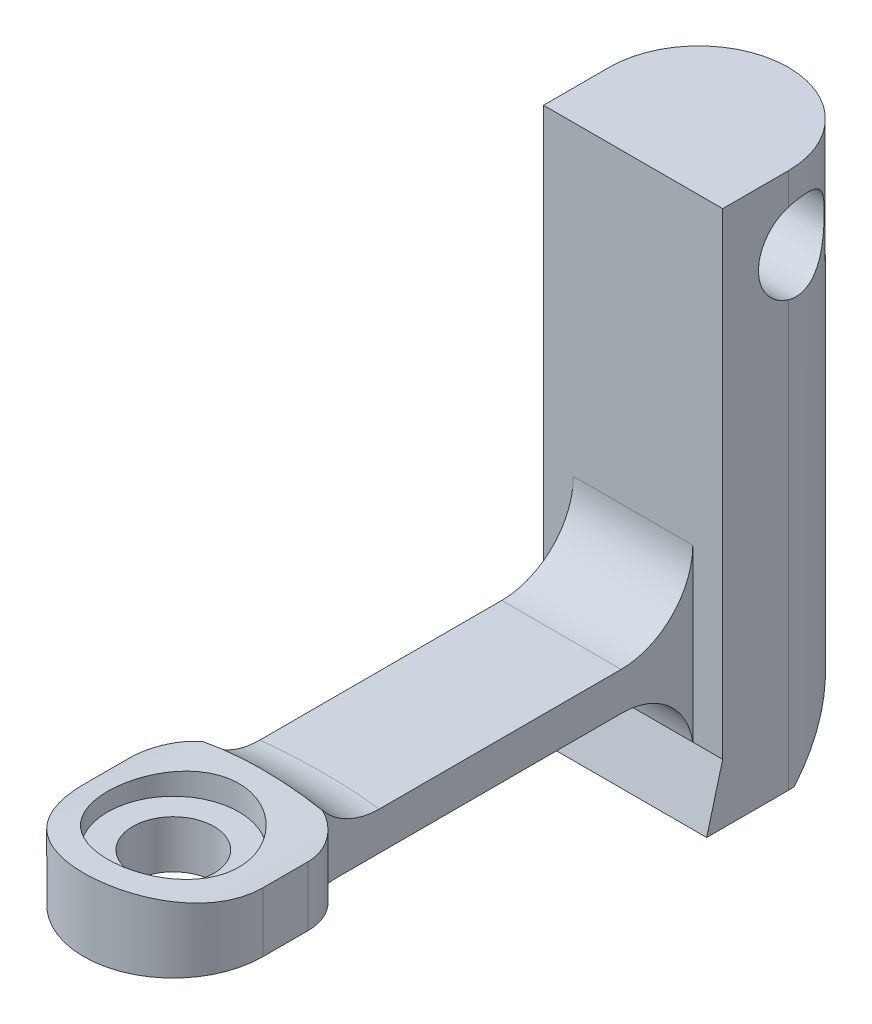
ISO-10303-21;
HEADER;
FILE_DESCRIPTION(('STEP AP214'),'2;1');
FILE_NAME('part.step','',(''),(''),'','','');
FILE_SCHEMA(('AUTOMOTIVE_DESIGN { 1 0 10303 214 1 1 1 1 }'));
ENDSEC;
DATA;
#1=APPLICATION_CONTEXT('core data for automotive mechanical design processes');
#2=APPLICATION_PROTOCOL_DEFINITION('international standard','automotive_design',2000,#1);
#3=PRODUCT_CONTEXT('',#1,'mechanical');
#4=PRODUCT('Part','Part','',(#3));
#5=PRODUCT_RELATED_PRODUCT_CATEGORY('part','',(#4));
#6=PRODUCT_DEFINITION_FORMATION('','',#4);
#7=PRODUCT_DEFINITION_CONTEXT('part definition',#1,'design');
#8=PRODUCT_DEFINITION('design','',#6,#7);
#9=PRODUCT_DEFINITION_SHAPE('','',#8);
#10=(LENGTH_UNIT() NAMED_UNIT(*) SI_UNIT(.MILLI.,.METRE.));
#11=(NAMED_UNIT(*) PLANE_ANGLE_UNIT() SI_UNIT($,.RADIAN.));
#12=(NAMED_UNIT(*) SI_UNIT($,.STERADIAN.) SOLID_ANGLE_UNIT());
#13=UNCERTAINTY_MEASURE_WITH_UNIT(LENGTH_MEASURE(1.E-05),#10,'distance_accuracy_value','');
#14=(GEOMETRIC_REPRESENTATION_CONTEXT(3) GLOBAL_UNCERTAINTY_ASSIGNED_CONTEXT((#13)) GLOBAL_UNIT_ASSIGNED_CONTEXT((#10,
#11,#12)) REPRESENTATION_CONTEXT('',''));
#15=CARTESIAN_POINT('',(0.,0.,0.));
#16=DIRECTION('',(0.,0.,1.));
#17=DIRECTION('',(1.,0.,0.));
#18=AXIS2_PLACEMENT_3D('',#15,#16,#17);
#19=CARTESIAN_POINT('',(3.75,8.4187500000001,49.5));
#20=DIRECTION('',(1.,0.,0.));
#21=DIRECTION('',(0.,1.,0.));
#22=AXIS2_PLACEMENT_3D('',#19,#20,#21);
#23=PLANE('',#22);
#24=DIRECTION('',(0.,-1.,0.));
#25=VECTOR('',#24,1.);
#26=CARTESIAN_POINT('',(3.75,11.2609280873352,62.3540496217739));
#27=LINE('',#26,#25);
#28=CARTESIAN_POINT('',(3.74999999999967,12.968712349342,62.3540496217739));
#29=VERTEX_POINT('',#28);
#30=CARTESIAN_POINT('',(3.74999999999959,10.4687123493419,62.3540496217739));
#31=VERTEX_POINT('',#30);
#32=EDGE_CURVE('E231',#29,#31,#27,.T.);
#33=ORIENTED_EDGE('',*,*,#32,.F.);
#34=DIRECTION('',(0.,0.,1.));
#35=VECTOR('',#34,1.);
#36=CARTESIAN_POINT('',(3.74999999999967,12.968712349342,60.5));
#37=LINE('',#36,#35);
#38=CARTESIAN_POINT('',(3.74999999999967,12.968712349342,64.25));
#39=VERTEX_POINT('',#38);
#40=EDGE_CURVE('E419',#29,#39,#37,.T.);
#41=ORIENTED_EDGE('',*,*,#40,.T.);
#42=DIRECTION('',(0.,1.,0.));
#43=VECTOR('',#42,1.);
#44=CARTESIAN_POINT('',(3.75,10.2015530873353,64.25));
#45=LINE('',#44,#43);
#46=CARTESIAN_POINT('',(3.74999999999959,10.4687123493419,64.25));
#47=VERTEX_POINT('',#46);
#48=EDGE_CURVE('E275',#47,#39,#45,.T.);
#49=ORIENTED_EDGE('',*,*,#48,.F.);
#50=DIRECTION('',(0.,0.,1.));
#51=VECTOR('',#50,1.);
#52=CARTESIAN_POINT('',(3.74999999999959,10.4687123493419,60.5));
#53=LINE('',#52,#51);
#54=EDGE_CURVE('E225',#31,#47,#53,.T.);
#55=ORIENTED_EDGE('',*,*,#54,.F.);
#56=EDGE_LOOP('',(#33,#41,#49,#55));
#57=FACE_BOUND('',#56,.T.);
#58=ADVANCED_FACE('F16',(#57),#23,.T.);
#59=CARTESIAN_POINT('',(0.,5.5,45.));
#60=DIRECTION('',(0.,-1.,0.));
#61=DIRECTION('',(0.,0.,-1.));
#62=AXIS2_PLACEMENT_3D('',#59,#60,#61);
#63=PLANE('',#62);
#64=CARTESIAN_POINT('',(0.,5.50000000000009,42.2500000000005));
#65=DIRECTION('',(0.,1.,0.));
#66=DIRECTION('',(0.707106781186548,0.,-0.707106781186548));
#67=AXIS2_PLACEMENT_3D('',#64,#65,#66);
#68=CIRCLE('',#67,3.75);
#69=CARTESIAN_POINT('',(3.75,5.5,42.2500000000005));
#70=VERTEX_POINT('',#69);
#71=CARTESIAN_POINT('',(3.74165738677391,5.5,42.));
#72=VERTEX_POINT('',#71);
#73=EDGE_CURVE('E125',#70,#72,#68,.T.);
#74=ORIENTED_EDGE('',*,*,#73,.F.);
#75=DIRECTION('',(0.,0.,1.));
#76=VECTOR('',#75,1.);
#77=CARTESIAN_POINT('',(3.75,5.5,45.5024047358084));
#78=LINE('',#77,#76);
#79=CARTESIAN_POINT('',(3.75,5.5,45.6698729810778));
#80=VERTEX_POINT('',#79);
#81=EDGE_CURVE('E121',#70,#80,#78,.T.);
#82=ORIENTED_EDGE('',*,*,#81,.T.);
#83=DIRECTION('',(1.,0.,0.));
#84=VECTOR('',#83,1.);
#85=CARTESIAN_POINT('',(-3.75,5.5,45.6698729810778));
#86=LINE('',#85,#84);
#87=CARTESIAN_POINT('',(-3.75,5.5,45.6698729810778));
#88=VERTEX_POINT('',#87);
#89=EDGE_CURVE('E26',#88,#80,#86,.T.);
#90=ORIENTED_EDGE('',*,*,#89,.F.);
#91=DIRECTION('',(0.,0.,1.));
#92=VECTOR('',#91,1.);
#93=CARTESIAN_POINT('',(-3.75,5.5,45.));
#94=LINE('',#93,#92);
#95=CARTESIAN_POINT('',(-3.75,5.5,42.2500000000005));
#96=VERTEX_POINT('',#95);
#97=EDGE_CURVE('E161',#96,#88,#94,.T.);
#98=ORIENTED_EDGE('',*,*,#97,.F.);
#99=CARTESIAN_POINT('',(0.,5.50000000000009,42.2500000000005));
#100=DIRECTION('',(0.,1.,0.));
#101=DIRECTION('',(-0.707106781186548,0.,-0.707106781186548));
#102=AXIS2_PLACEMENT_3D('',#99,#100,#101);
#103=CIRCLE('',#102,3.75);
#104=CARTESIAN_POINT('',(-3.74165738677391,5.5,42.));
#105=VERTEX_POINT('',#104);
#106=EDGE_CURVE('E154',#105,#96,#103,.T.);
#107=ORIENTED_EDGE('',*,*,#106,.F.);
#108=DIRECTION('',(1.,0.,0.));
#109=VECTOR('',#108,1.);
#110=CARTESIAN_POINT('',(0.,5.5,42.));
#111=LINE('',#110,#109);
#112=EDGE_CURVE('E11',#105,#72,#111,.T.);
#113=ORIENTED_EDGE('',*,*,#112,.T.);
#114=EDGE_LOOP('',(#74,#82,#90,#98,#107,#113));
#115=FACE_BOUND('',#114,.T.);
#116=ADVANCED_FACE('F122',(#115),#63,.T.);
#117=CARTESIAN_POINT('',(0.,5.5,42.));
#118=DIRECTION('',(0.,-0.707106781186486,-0.70710678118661));
#119=DIRECTION('',(0.,-0.70710678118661,0.707106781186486));
#120=AXIS2_PLACEMENT_3D('',#117,#118,#119);
#121=PLANE('',#120);
#122=CARTESIAN_POINT('',(0.,5.24999999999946,42.2500000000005));
#123=DIRECTION('',(0.,0.707106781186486,0.707106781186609));
#124=DIRECTION('',(0.,0.707106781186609,-0.707106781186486));
#125=AXIS2_PLACEMENT_3D('',#122,#123,#124);
#126=ELLIPSE('',#125,5.30330085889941,3.75);
#127=EDGE_CURVE('E151',#72,#105,#126,.T.);
#128=ORIENTED_EDGE('',*,*,#127,.F.);
#129=ORIENTED_EDGE('',*,*,#112,.F.);
#130=EDGE_LOOP('',(#128,#129));
#131=FACE_BOUND('',#130,.T.);
#132=ADVANCED_FACE('F395',(#131),#121,.T.);
#133=CARTESIAN_POINT('',(0.,10.5374999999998,60.5));
#134=DIRECTION('',(0.,-1.,0.));
#135=DIRECTION('',(0.,0.,-1.));
#136=AXIS2_PLACEMENT_3D('',#133,#134,#135);
#137=PLANE('',#136);
#138=DIRECTION('',(1.,0.,0.));
#139=VECTOR('',#138,1.);
#140=CARTESIAN_POINT('',(3.74999999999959,10.5374999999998,59.861255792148));
#141=LINE('',#140,#139);
#142=CARTESIAN_POINT('',(-2.5,10.5374999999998,59.861255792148));
#143=VERTEX_POINT('',#142);
#144=CARTESIAN_POINT('',(2.5,10.5374999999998,59.861255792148));
#145=VERTEX_POINT('',#144);
#146=EDGE_CURVE('E242',#143,#145,#141,.T.);
#147=ORIENTED_EDGE('',*,*,#146,.F.);
#148=DIRECTION('',(0.,0.,-1.));
#149=VECTOR('',#148,1.);
#150=CARTESIAN_POINT('',(-2.5,10.5374999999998,60.5));
#151=LINE('',#150,#149);
#152=CARTESIAN_POINT('',(-2.5,10.5375,47.9641345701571));
#153=VERTEX_POINT('',#152);
#154=EDGE_CURVE('E130',#143,#153,#151,.T.);
#155=ORIENTED_EDGE('',*,*,#154,.T.);
#156=DIRECTION('',(-1.,0.,0.));
#157=VECTOR('',#156,1.);
#158=CARTESIAN_POINT('',(-1.875,10.5375,47.9641345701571));
#159=LINE('',#158,#157);
#160=CARTESIAN_POINT('',(2.5,10.5375,47.9641345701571));
#161=VERTEX_POINT('',#160);
#162=EDGE_CURVE('E200',#161,#153,#159,.T.);
#163=ORIENTED_EDGE('',*,*,#162,.F.);
#164=DIRECTION('',(0.,0.,1.));
#165=VECTOR('',#164,1.);
#166=CARTESIAN_POINT('',(2.5,10.5375,52.75));
#167=LINE('',#166,#165);
#168=EDGE_CURVE('E191',#161,#145,#167,.T.);
#169=ORIENTED_EDGE('',*,*,#168,.T.);
#170=EDGE_LOOP('',(#147,#155,#163,#169));
#171=FACE_BOUND('',#170,.T.);
#172=ADVANCED_FACE('F391',(#171),#137,.T.);
#173=CARTESIAN_POINT('',(-3.75,8.,45.));
#174=DIRECTION('',(0.,0.25881904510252,0.965925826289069));
#175=DIRECTION('',(1.,0.,0.));
#176=AXIS2_PLACEMENT_3D('',#173,#174,#175);
#177=PLANE('',#176);
#178=DIRECTION('',(0.,0.965925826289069,-0.25881904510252));
#179=VECTOR('',#178,1.);
#180=CARTESIAN_POINT('',(3.75,7.375,45.1674682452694));
#181=LINE('',#180,#179);
#182=CARTESIAN_POINT('',(3.75,8.,45.));
#183=VERTEX_POINT('',#182);
#184=EDGE_CURVE('E108',#80,#183,#181,.T.);
#185=ORIENTED_EDGE('',*,*,#184,.T.);
#186=DIRECTION('',(1.,0.,0.));
#187=VECTOR('',#186,1.);
#188=CARTESIAN_POINT('',(-1.875,8.,45.));
#189=LINE('',#188,#187);
#190=CARTESIAN_POINT('',(2.5,8.,45.));
#191=VERTEX_POINT('',#190);
#192=EDGE_CURVE('E165',#191,#183,#189,.T.);
#193=ORIENTED_EDGE('',*,*,#192,.F.);
#194=DIRECTION('',(1.,0.,0.));
#195=VECTOR('',#194,1.);
#196=CARTESIAN_POINT('',(-1.875,8.,45.));
#197=LINE('',#196,#195);
#198=CARTESIAN_POINT('',(-2.5,8.,45.));
#199=VERTEX_POINT('',#198);
#200=EDGE_CURVE('E166',#199,#191,#197,.T.);
#201=ORIENTED_EDGE('',*,*,#200,.F.);
#202=DIRECTION('',(1.,0.,0.));
#203=VECTOR('',#202,1.);
#204=CARTESIAN_POINT('',(-1.875,8.,45.));
#205=LINE('',#204,#203);
#206=CARTESIAN_POINT('',(-3.75,8.,45.));
#207=VERTEX_POINT('',#206);
#208=EDGE_CURVE('E178',#207,#199,#205,.T.);
#209=ORIENTED_EDGE('',*,*,#208,.F.);
#210=DIRECTION('',(0.,-0.965925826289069,0.25881904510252));
#211=VECTOR('',#210,1.);
#212=CARTESIAN_POINT('',(-3.75,8.,45.));
#213=LINE('',#212,#211);
#214=EDGE_CURVE('E113',#207,#88,#213,.T.);
#215=ORIENTED_EDGE('',*,*,#214,.T.);
#216=ORIENTED_EDGE('',*,*,#89,.T.);
#217=EDGE_LOOP('',(#185,#193,#201,#209,#215,#216));
#218=FACE_BOUND('',#217,.T.);
#219=ADVANCED_FACE('F106',(#218),#177,.T.);
#220=CARTESIAN_POINT('',(-1.83371836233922E-13,17.3437123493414,64.25));
#221=DIRECTION('',(0.,1.,0.));
#222=DIRECTION('',(0.,0.,-1.));
#223=AXIS2_PLACEMENT_3D('',#220,#221,#222);
#224=CYLINDRICAL_SURFACE('',#223,1.7);
#225=CARTESIAN_POINT('',(-2.03725925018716E-13,10.4687123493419,64.25));
#226=DIRECTION('',(0.,1.,0.));
#227=DIRECTION('',(0.,0.,-1.));
#228=AXIS2_PLACEMENT_3D('',#225,#226,#227);
#229=CIRCLE('',#228,1.7);
#230=CARTESIAN_POINT('',(-2.03517735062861E-13,10.4687123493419,65.95));
#231=VERTEX_POINT('',#230);
#232=EDGE_CURVE('E272',#231,#231,#229,.T.);
#233=ORIENTED_EDGE('',*,*,#232,.F.);
#234=DIRECTION('',(0.,1.,0.));
#235=VECTOR('',#234,1.);
#236=CARTESIAN_POINT('',(-1.83163646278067E-13,17.3437123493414,65.95));
#237=LINE('',#236,#235);
#238=CARTESIAN_POINT('',(-1.97596545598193E-13,12.4687123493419,65.95));
#239=VERTEX_POINT('',#238);
#240=EDGE_CURVE('E39',#231,#239,#237,.T.);
#241=ORIENTED_EDGE('',*,*,#240,.T.);
#242=CARTESIAN_POINT('',(-1.97804735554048E-13,12.4687123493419,64.25));
#243=DIRECTION('',(0.,1.,0.));
#244=DIRECTION('',(0.,0.,-1.));
#245=AXIS2_PLACEMENT_3D('',#242,#243,#244);
#246=CIRCLE('',#245,1.7);
#247=EDGE_CURVE('E282',#239,#239,#246,.T.);
#248=ORIENTED_EDGE('',*,*,#247,.T.);
#249=ORIENTED_EDGE('',*,*,#240,.F.);
#250=EDGE_LOOP('',(#233,#241,#248,#249));
#251=FACE_BOUND('',#250,.T.);
#252=ADVANCED_FACE('F387',(#251),#224,.F.);
#253=CARTESIAN_POINT('',(-2.21573146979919E-13,12.4687123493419,64.25));
#254=DIRECTION('',(0.,-1.,0.));
#255=DIRECTION('',(-1.,0.,0.));
#256=AXIS2_PLACEMENT_3D('',#253,#254,#255);
#257=PLANE('',#256);
#258=ORIENTED_EDGE('',*,*,#247,.F.);
#259=EDGE_LOOP('',(#258));
#260=FACE_BOUND('',#259,.T.);
#261=CARTESIAN_POINT('',(-2.21480516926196E-13,12.4687123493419,64.25));
#262=DIRECTION('',(0.,-1.,0.));
#263=DIRECTION('',(1.,0.,0.));
#264=AXIS2_PLACEMENT_3D('',#261,#262,#263);
#265=CIRCLE('',#264,2.75);
#266=CARTESIAN_POINT('',(-2.75000000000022,12.4687123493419,64.25));
#267=VERTEX_POINT('',#266);
#268=EDGE_CURVE('E186',#267,#267,#265,.T.);
#269=ORIENTED_EDGE('',*,*,#268,.F.);
#270=EDGE_LOOP('',(#269));
#271=FACE_BOUND('',#270,.T.);
#272=ADVANCED_FACE('F381',(#260,#271),#257,.F.);
#273=CARTESIAN_POINT('',(-2.21480516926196E-13,12.4687123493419,64.25));
#274=DIRECTION('',(0.,1.,0.));
#275=DIRECTION('',(1.,0.,0.));
#276=AXIS2_PLACEMENT_3D('',#273,#274,#275);
#277=CYLINDRICAL_SURFACE('',#276,2.75);
#278=ORIENTED_EDGE('',*,*,#268,.T.);
#279=DIRECTION('',(0.,1.,0.));
#280=VECTOR('',#279,1.);
#281=CARTESIAN_POINT('',(-2.75000000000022,12.4687123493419,64.25));
#282=LINE('',#281,#280);
#283=CARTESIAN_POINT('',(-2.75000000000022,13.2169398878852,64.25));
#284=VERTEX_POINT('',#283);
#285=EDGE_CURVE('E190',#267,#284,#282,.T.);
#286=ORIENTED_EDGE('',*,*,#285,.T.);
#287=CARTESIAN_POINT('',(2.74999999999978,13.2169398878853,64.25));
#288=CARTESIAN_POINT('',(2.74999442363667,13.216942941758,64.0972606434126));
#289=CARTESIAN_POINT('',(2.73723169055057,13.219616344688,63.9444516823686));
#290=CARTESIAN_POINT('',(2.68656304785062,13.2300046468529,63.6431609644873));
#291=CARTESIAN_POINT('',(2.64863739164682,13.2377235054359,63.4946827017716));
#292=CARTESIAN_POINT('',(2.5488713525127,13.2572930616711,63.2064557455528));
#293=CARTESIAN_POINT('',(2.48705522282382,13.2691395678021,63.066698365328));
#294=CARTESIAN_POINT('',(2.34132996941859,13.2956246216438,62.7995407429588));
#295=CARTESIAN_POINT('',(2.25742192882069,13.3102630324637,62.6721398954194));
#296=CARTESIAN_POINT('',(2.0685829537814,13.3409223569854,62.4314376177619));
#297=CARTESIAN_POINT('',(1.96338990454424,13.3569589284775,62.3183437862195));
#298=CARTESIAN_POINT('',(1.73553318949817,13.3884699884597,62.1112793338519));
#299=CARTESIAN_POINT('',(1.6128682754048,13.4039444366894,62.017310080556));
#300=CARTESIAN_POINT('',(1.35217179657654,13.4327568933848,61.8503536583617));
#301=CARTESIAN_POINT('',(1.2140111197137,13.446074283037,61.7775642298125));
#302=CARTESIAN_POINT('',(0.927103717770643,13.4688960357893,61.6563103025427));
#303=CARTESIAN_POINT('',(0.778358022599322,13.4784007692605,61.607843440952));
#304=CARTESIAN_POINT('',(0.47665820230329,13.4924156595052,61.5372579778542));
#305=CARTESIAN_POINT('',(0.323789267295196,13.4969922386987,61.5147886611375));
#306=CARTESIAN_POINT('',(0.016387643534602,13.5008647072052,61.4957414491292));
#307=CARTESIAN_POINT('',(-0.138144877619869,13.5001611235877,61.4991609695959));
#308=CARTESIAN_POINT('',(-0.442075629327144,13.4936038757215,61.5315292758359));
#309=CARTESIAN_POINT('',(-0.591515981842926,13.4878264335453,61.5601002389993));
#310=CARTESIAN_POINT('',(-0.883435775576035,13.4718567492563,61.6413605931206));
#311=CARTESIAN_POINT('',(-1.02591493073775,13.4616643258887,61.6940509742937));
#312=CARTESIAN_POINT('',(-1.30094016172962,13.4378848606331,61.822401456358));
#313=CARTESIAN_POINT('',(-1.43341564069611,13.4242761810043,61.8982086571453));
#314=CARTESIAN_POINT('',(-1.68390496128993,13.3951628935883,62.0705318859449));
#315=CARTESIAN_POINT('',(-1.80191707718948,13.3796580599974,62.1670503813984));
#316=CARTESIAN_POINT('',(-2.02237291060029,13.3481329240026,62.380126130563));
#317=CARTESIAN_POINT('',(-2.12449666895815,13.3321083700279,62.497014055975));
#318=CARTESIAN_POINT('',(-2.30774608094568,13.3016150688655,62.7464196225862));
#319=CARTESIAN_POINT('',(-2.38887130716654,13.2871463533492,62.8789375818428));
#320=CARTESIAN_POINT('',(-2.5279371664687,13.2613939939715,63.1563120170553));
#321=CARTESIAN_POINT('',(-2.58582435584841,13.2501177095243,63.3011960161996));
#322=CARTESIAN_POINT('',(-2.67633889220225,13.2321336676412,63.5989171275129));
#323=CARTESIAN_POINT('',(-2.7089696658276,13.2254252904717,63.7517531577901));
#324=CARTESIAN_POINT('',(-2.74756346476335,13.2174612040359,64.0581354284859));
#325=CARTESIAN_POINT('',(-2.75398926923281,13.2161108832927,64.2116209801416));
#326=CARTESIAN_POINT('',(-2.74123747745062,13.2187615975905,64.5174707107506));
#327=CARTESIAN_POINT('',(-2.72206139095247,13.2227623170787,64.6698349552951));
#328=CARTESIAN_POINT('',(-2.65904961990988,13.2355755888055,64.9675508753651));
#329=CARTESIAN_POINT('',(-2.61546265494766,13.2443395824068,65.1129574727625));
#330=CARTESIAN_POINT('',(-2.50513298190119,13.2656491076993,65.3944040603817));
#331=CARTESIAN_POINT('',(-2.43838830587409,13.2781949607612,65.5304432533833));
#332=CARTESIAN_POINT('',(-2.28259564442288,13.3058662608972,65.7913141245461));
#333=CARTESIAN_POINT('',(-2.19325894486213,13.3210242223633,65.9159698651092));
#334=CARTESIAN_POINT('',(-1.99520166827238,13.3521232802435,66.1486896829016));
#335=CARTESIAN_POINT('',(-1.88647901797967,13.368064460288,66.2567519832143));
#336=CARTESIAN_POINT('',(-1.65065536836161,13.39924177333,66.4549799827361));
#337=CARTESIAN_POINT('',(-1.52328857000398,13.4144625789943,66.5448322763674));
#338=CARTESIAN_POINT('',(-1.25499897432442,13.4422147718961,66.7018632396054));
#339=CARTESIAN_POINT('',(-1.11407676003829,13.4547462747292,66.769042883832));
#340=CARTESIAN_POINT('',(-0.823487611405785,13.4756426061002,66.8783686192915));
#341=CARTESIAN_POINT('',(-0.673877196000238,13.4840315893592,66.9206601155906));
#342=CARTESIAN_POINT('',(-0.369487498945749,13.4958014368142,66.979468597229));
#343=CARTESIAN_POINT('',(-0.21470886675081,13.4991829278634,66.9959888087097));
#344=CARTESIAN_POINT('',(0.0926336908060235,13.500541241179,67.0026569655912));
#345=CARTESIAN_POINT('',(0.245187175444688,13.4986144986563,66.9932754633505));
#346=CARTESIAN_POINT('',(0.546494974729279,13.4897763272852,66.9494480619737));
#347=CARTESIAN_POINT('',(0.695249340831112,13.4828649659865,66.9150025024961));
#348=CARTESIAN_POINT('',(0.984429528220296,13.4648376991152,66.82223713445));
#349=CARTESIAN_POINT('',(1.12487480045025,13.4537321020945,66.7639758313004));
#350=CARTESIAN_POINT('',(1.39406294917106,13.428510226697,66.6252932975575));
#351=CARTESIAN_POINT('',(1.5228048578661,13.4143936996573,66.5448702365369));
#352=CARTESIAN_POINT('',(1.76725255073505,13.3844034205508,66.3625699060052));
#353=CARTESIAN_POINT('',(1.88270499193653,13.3685042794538,66.2603570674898));
#354=CARTESIAN_POINT('',(2.09498077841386,13.3368887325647,66.0380657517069));
#355=CARTESIAN_POINT('',(2.19179969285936,13.3211723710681,65.9179830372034));
#356=CARTESIAN_POINT('',(2.36509821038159,13.2915066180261,65.6617384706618));
#357=CARTESIAN_POINT('',(2.44133665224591,13.2775791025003,65.5254108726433));
#358=CARTESIAN_POINT('',(2.56970253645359,13.2533365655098,65.2416326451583));
#359=CARTESIAN_POINT('',(2.62185157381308,13.2430183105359,65.0941921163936));
#360=CARTESIAN_POINT('',(2.69059797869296,13.2291934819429,64.8303761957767));
#361=CARTESIAN_POINT('',(2.71283334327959,13.2246272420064,64.7154922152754));
#362=CARTESIAN_POINT('',(2.74253621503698,13.2184993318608,64.4837523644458));
#363=CARTESIAN_POINT('',(2.75000426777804,13.2169375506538,64.366896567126));
#364=CARTESIAN_POINT('',(2.74999999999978,13.2169398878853,64.25));
#365=B_SPLINE_CURVE_WITH_KNOTS('',3,(#287,#288,#289,#290,#291,#292,#293,#294,#295,#296,#297,
#298,#299,#300,#301,#302,#303,#304,#305,#306,#307,#308,#309,#310,#311,#312,#313,#314,#315,#316,
#317,#318,#319,#320,#321,#322,#323,#324,#325,#326,#327,#328,#329,#330,#331,#332,#333,#334,#335,
#336,#337,#338,#339,#340,#341,#342,#343,#344,#345,#346,#347,#348,#349,#350,#351,#352,#353,#354,
#355,#356,#357,#358,#359,#360,#361,#362,#363,#364),.UNSPECIFIED.,.T.,.F.,(4,2,2,2,2,2,2,2,2,2,2,
2,2,2,2,2,2,2,2,2,2,2,2,2,2,2,2,2,2,2,2,2,2,2,2,2,2,2,4),(0.,0.457789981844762,
0.915939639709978,1.37362540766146,1.8312887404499,2.29497456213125,2.75869352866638,
3.2266123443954,3.69448569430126,4.15597085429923,4.61740994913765,5.07203341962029,
5.52667555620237,5.98427333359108,6.44192565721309,6.90785016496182,7.37378415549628,
7.84078366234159,8.30771979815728,8.76637317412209,9.22499950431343,9.67903579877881,
10.1331106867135,10.5933107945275,11.0535601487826,11.5211604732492,11.9887406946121,
12.4535613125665,12.9183237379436,13.374698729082,13.8310675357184,14.2863219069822,
14.741613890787,15.2045022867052,15.6675006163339,16.1357095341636,16.6034979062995,
16.9538729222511,17.3042349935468),.UNSPECIFIED.);
#366=EDGE_CURVE('E364',#284,#284,#365,.F.);
#367=ORIENTED_EDGE('',*,*,#366,.F.);
#368=ORIENTED_EDGE('',*,*,#285,.F.);
#369=EDGE_LOOP('',(#278,#286,#367,#368));
#370=FACE_BOUND('',#369,.T.);
#371=ADVANCED_FACE('F375',(#370),#277,.F.);
#372=CARTESIAN_POINT('',(2.5,10.5375,45.));
#373=DIRECTION('',(-1.,0.,0.));
#374=DIRECTION('',(0.,0.,1.));
#375=AXIS2_PLACEMENT_3D('',#372,#373,#374);
#376=PLANE('',#375);
#377=DIRECTION('',(0.,1.,0.));
#378=VECTOR('',#377,1.);
#379=CARTESIAN_POINT('',(2.5,11.2609280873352,60.5));
#380=LINE('',#379,#378);
#381=CARTESIAN_POINT('',(2.5,10.4687123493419,60.5));
#382=VERTEX_POINT('',#381);
#383=CARTESIAN_POINT('',(2.49999999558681,13.2664991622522,60.5));
#384=VERTEX_POINT('',#383);
#385=EDGE_CURVE('E230',#382,#384,#380,.T.);
#386=ORIENTED_EDGE('',*,*,#385,.F.);
#387=CARTESIAN_POINT('',(2.5,7.53749999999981,59.8612557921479));
#388=DIRECTION('',(-1.,0.,0.));
#389=DIRECTION('',(0.,0.977070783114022,0.21291473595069));
#390=AXIS2_PLACEMENT_3D('',#387,#388,#389);
#391=CIRCLE('',#390,3.);
#392=EDGE_CURVE('E246',#382,#145,#391,.T.);
#393=ORIENTED_EDGE('',*,*,#392,.T.);
#394=ORIENTED_EDGE('',*,*,#168,.F.);
#395=CARTESIAN_POINT('',(2.5,7.5375,47.964134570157));
#396=DIRECTION('',(1.,0.,0.));
#397=DIRECTION('',(0.,0.154166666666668,-0.98804485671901));
#398=AXIS2_PLACEMENT_3D('',#395,#396,#397);
#399=CIRCLE('',#398,3.);
#400=EDGE_CURVE('E196',#191,#161,#399,.T.);
#401=ORIENTED_EDGE('',*,*,#400,.F.);
#402=DIRECTION('',(0.,-1.,0.));
#403=VECTOR('',#402,1.);
#404=CARTESIAN_POINT('',(2.5,13.8453030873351,45.));
#405=LINE('',#404,#403);
#406=CARTESIAN_POINT('',(2.5,15.1374999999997,45.));
#407=VERTEX_POINT('',#406);
#408=EDGE_CURVE('E162',#407,#191,#405,.T.);
#409=ORIENTED_EDGE('',*,*,#408,.F.);
#410=CARTESIAN_POINT('',(2.5,15.1374999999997,48.));
#411=DIRECTION('',(1.,0.,0.));
#412=DIRECTION('',(0.,-0.707106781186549,-0.707106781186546));
#413=AXIS2_PLACEMENT_3D('',#410,#411,#412);
#414=CIRCLE('',#413,3.);
#415=CARTESIAN_POINT('',(2.5,12.1374999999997,48.));
#416=VERTEX_POINT('',#415);
#417=EDGE_CURVE('E219',#416,#407,#414,.T.);
#418=ORIENTED_EDGE('',*,*,#417,.F.);
#419=DIRECTION('',(0.,0.,-1.));
#420=VECTOR('',#419,1.);
#421=CARTESIAN_POINT('',(2.5,12.1374999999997,41.75));
#422=LINE('',#421,#420);
#423=CARTESIAN_POINT('',(2.49999999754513,12.1374999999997,58.1325115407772));
#424=VERTEX_POINT('',#423);
#425=EDGE_CURVE('E241',#424,#416,#422,.T.);
#426=ORIENTED_EDGE('',*,*,#425,.F.);
#427=CARTESIAN_POINT('',(2.5,13.2664991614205,60.5));
#428=CARTESIAN_POINT('',(2.49905278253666,13.2237740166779,60.4653774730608));
#429=CARTESIAN_POINT('',(2.49823868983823,13.1820461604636,60.4295265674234));
#430=CARTESIAN_POINT('',(2.49684433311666,13.1005518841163,60.3554145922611));
#431=CARTESIAN_POINT('',(2.49626478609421,13.0607917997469,60.3171465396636));
#432=CARTESIAN_POINT('',(2.49531083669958,12.9833267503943,60.2383229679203));
#433=CARTESIAN_POINT('',(2.49493714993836,12.9456293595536,60.1977600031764));
#434=CARTESIAN_POINT('',(2.49436691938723,12.8723821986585,60.1144717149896));
#435=CARTESIAN_POINT('',(2.49417103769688,12.8368409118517,60.0717389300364));
#436=CARTESIAN_POINT('',(2.49392894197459,12.7680012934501,59.984239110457));
#437=CARTESIAN_POINT('',(2.49388330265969,12.7347120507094,59.9394649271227));
#438=CARTESIAN_POINT('',(2.49391477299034,12.670473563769,59.84801335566));
#439=CARTESIAN_POINT('',(2.49399235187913,12.6395337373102,59.8013293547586));
#440=CARTESIAN_POINT('',(2.49424388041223,12.580093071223,59.7061922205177));
#441=CARTESIAN_POINT('',(2.49441818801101,12.5516017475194,59.6577331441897));
#442=CARTESIAN_POINT('',(2.49483733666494,12.4971588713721,59.5591829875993));
#443=CARTESIAN_POINT('',(2.49508242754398,12.4712167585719,59.5090866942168));
#444=CARTESIAN_POINT('',(2.49561784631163,12.4219748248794,59.4074023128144));
#445=CARTESIAN_POINT('',(2.49590832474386,12.398684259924,59.3558097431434));
#446=CARTESIAN_POINT('',(2.49650976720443,12.3548495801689,59.251276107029));
#447=CARTESIAN_POINT('',(2.49682079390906,12.3343145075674,59.1983312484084));
#448=CARTESIAN_POINT('',(2.49743913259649,12.2960965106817,59.0912394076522));
#449=CARTESIAN_POINT('',(2.49774643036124,12.2784224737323,59.03708925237));
#450=CARTESIAN_POINT('',(2.49833367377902,12.246033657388,58.9277362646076));
#451=CARTESIAN_POINT('',(2.49861353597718,12.2313277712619,58.8725307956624));
#452=CARTESIAN_POINT('',(2.49912283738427,12.20498369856,58.761219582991));
#453=CARTESIAN_POINT('',(2.49935212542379,12.1933546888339,58.7051116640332));
#454=CARTESIAN_POINT('',(2.49973782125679,12.1732738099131,58.5921511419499));
#455=CARTESIAN_POINT('',(2.4998940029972,12.1648318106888,58.5352967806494));
#456=CARTESIAN_POINT('',(2.50011153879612,12.1512359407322,58.4210009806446));
#457=CARTESIAN_POINT('',(2.50017257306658,12.1460931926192,58.3635582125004));
#458=CARTESIAN_POINT('',(2.50017885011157,12.1392055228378,58.2482491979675));
#459=CARTESIAN_POINT('',(2.5001236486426,12.1374736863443,58.1903821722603));
#460=CARTESIAN_POINT('',(2.50000000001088,12.1374998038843,58.1325115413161));
#461=B_SPLINE_CURVE_WITH_KNOTS('',3,(#427,#428,#429,#430,#431,#432,#433,#434,#435,#436,#437,
#438,#439,#440,#441,#442,#443,#444,#445,#446,#447,#448,#449,#450,#451,#452,#453,#454,#455,#456,
#457,#458,#459,#460),.UNSPECIFIED.,.F.,.F.,(4,2,2,2,2,2,2,2,2,2,2,2,2,2,2,2,4),(0.,
0.164973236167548,0.330447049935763,0.496492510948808,0.663153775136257,0.830451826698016,
0.998388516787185,1.16695085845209,1.33611555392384,1.50585374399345,1.6761359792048,
1.84693741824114,2.0182432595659,2.1900544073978,2.36239336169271,2.53531030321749,
2.70888931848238),.UNSPECIFIED.);
#462=EDGE_CURVE('E305',#384,#424,#461,.T.);
#463=ORIENTED_EDGE('',*,*,#462,.F.);
#464=EDGE_LOOP('',(#386,#393,#394,#401,#409,#418,#426,#463));
#465=FACE_BOUND('',#464,.T.);
#466=ADVANCED_FACE('F380',(#465),#376,.F.);
#467=CARTESIAN_POINT('',(-2.5,10.5375,60.5));
#468=DIRECTION('',(1.,0.,0.));
#469=DIRECTION('',(0.,0.,1.));
#470=AXIS2_PLACEMENT_3D('',#467,#468,#469);
#471=PLANE('',#470);
#472=DIRECTION('',(0.,1.,0.));
#473=VECTOR('',#472,1.);
#474=CARTESIAN_POINT('',(-2.5,13.8453030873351,45.));
#475=LINE('',#474,#473);
#476=CARTESIAN_POINT('',(-2.5,15.1374999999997,45.));
#477=VERTEX_POINT('',#476);
#478=EDGE_CURVE('E173',#199,#477,#475,.T.);
#479=ORIENTED_EDGE('',*,*,#478,.F.);
#480=CARTESIAN_POINT('',(-2.5,7.5375,47.964134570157));
#481=DIRECTION('',(1.,0.,0.));
#482=DIRECTION('',(0.,0.154166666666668,-0.98804485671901));
#483=AXIS2_PLACEMENT_3D('',#480,#481,#482);
#484=CIRCLE('',#483,3.);
#485=EDGE_CURVE('E235',#199,#153,#484,.T.);
#486=ORIENTED_EDGE('',*,*,#485,.T.);
#487=ORIENTED_EDGE('',*,*,#154,.F.);
#488=CARTESIAN_POINT('',(-2.5,7.53749999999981,59.8612557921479));
#489=DIRECTION('',(-1.,0.,0.));
#490=DIRECTION('',(0.,0.977070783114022,0.21291473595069));
#491=AXIS2_PLACEMENT_3D('',#488,#489,#490);
#492=CIRCLE('',#491,3.);
#493=CARTESIAN_POINT('',(-2.5,10.4687123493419,60.5));
#494=VERTEX_POINT('',#493);
#495=EDGE_CURVE('E149',#494,#143,#492,.T.);
#496=ORIENTED_EDGE('',*,*,#495,.F.);
#497=DIRECTION('',(0.,-1.,0.));
#498=VECTOR('',#497,1.);
#499=CARTESIAN_POINT('',(-2.5,11.2609280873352,60.5));
#500=LINE('',#499,#498);
#501=CARTESIAN_POINT('',(-2.4999999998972,13.2664991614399,60.5));
#502=VERTEX_POINT('',#501);
#503=EDGE_CURVE('E351',#502,#494,#500,.T.);
#504=ORIENTED_EDGE('',*,*,#503,.F.);
#505=CARTESIAN_POINT('',(-2.50000000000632,12.1374999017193,58.1325115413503));
#506=CARTESIAN_POINT('',(-2.50012252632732,12.1374693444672,58.1903773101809));
#507=CARTESIAN_POINT('',(-2.50017663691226,12.1391974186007,58.2482395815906));
#508=CARTESIAN_POINT('',(-2.50016826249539,12.1460786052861,58.3635398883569));
#509=CARTESIAN_POINT('',(-2.50010622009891,12.1512186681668,58.4209787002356));
#510=CARTESIAN_POINT('',(-2.49988676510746,12.1648099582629,58.5352673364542));
#511=CARTESIAN_POINT('',(-2.49972967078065,12.1732501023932,58.5921184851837));
#512=CARTESIAN_POINT('',(-2.49934225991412,12.1933278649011,58.7050733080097));
#513=CARTESIAN_POINT('',(-2.49911216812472,12.204955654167,58.7611787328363));
#514=CARTESIAN_POINT('',(-2.49860138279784,12.2312977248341,58.8724856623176));
#515=CARTESIAN_POINT('',(-2.4983208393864,12.2460028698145,58.9276893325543));
#516=CARTESIAN_POINT('',(-2.49773237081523,12.2783905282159,59.0370394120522));
#517=CARTESIAN_POINT('',(-2.49742452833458,12.2960641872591,59.0911884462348));
#518=CARTESIAN_POINT('',(-2.4968052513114,12.3342816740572,59.1982787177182));
#519=CARTESIAN_POINT('',(-2.49649383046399,12.3548166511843,59.2512231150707));
#520=CARTESIAN_POINT('',(-2.49589176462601,12.3986513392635,59.3557564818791));
#521=CARTESIAN_POINT('',(-2.49560105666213,12.4219420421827,59.4073492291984));
#522=CARTESIAN_POINT('',(-2.49506535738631,12.4711844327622,59.5090345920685));
#523=CARTESIAN_POINT('',(-2.49482021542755,12.4971268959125,59.5591316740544));
#524=CARTESIAN_POINT('',(-2.49440115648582,12.5515706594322,59.657683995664));
#525=CARTESIAN_POINT('',(-2.49422698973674,12.5800625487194,59.7061444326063));
#526=CARTESIAN_POINT('',(-2.49397594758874,12.6395045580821,59.8012848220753));
#527=CARTESIAN_POINT('',(-2.49389871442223,12.6704451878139,59.8479707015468));
#528=CARTESIAN_POINT('',(-2.49386815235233,12.7346855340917,59.9394264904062));
#529=CARTESIAN_POINT('',(-2.49391435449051,12.7679758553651,59.9842029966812));
#530=CARTESIAN_POINT('',(-2.49415780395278,12.8368179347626,60.0717078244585));
#531=CARTESIAN_POINT('',(-2.49435447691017,12.8723606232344,60.1144432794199));
#532=CARTESIAN_POINT('',(-2.49492652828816,12.945610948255,60.1977371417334));
#533=CARTESIAN_POINT('',(-2.49530124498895,12.9833101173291,60.2383029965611));
#534=CARTESIAN_POINT('',(-2.49625750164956,13.0607791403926,60.3171324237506));
#535=CARTESIAN_POINT('',(-2.49683832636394,13.1005414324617,60.355403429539));
#536=CARTESIAN_POINT('',(-2.49823549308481,13.1820405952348,60.4295211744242));
#537=CARTESIAN_POINT('',(-2.4990511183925,13.2237711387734,60.4653748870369));
#538=CARTESIAN_POINT('',(-2.5,13.2664991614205,60.5));
#539=B_SPLINE_CURVE_WITH_KNOTS('',3,(#505,#506,#507,#508,#509,#510,#511,#512,#513,#514,#515,
#516,#517,#518,#519,#520,#521,#522,#523,#524,#525,#526,#527,#528,#529,#530,#531,#532,#533,#534,
#535,#536,#537,#538),.UNSPECIFIED.,.F.,.F.,(4,2,2,2,2,2,2,2,2,2,2,2,2,2,2,2,4),(0.,
0.173564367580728,0.346468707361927,0.518797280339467,0.690600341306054,0.861900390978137,
1.03269828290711,1.20297913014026,1.37271798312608,1.54188526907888,1.71045199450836,
1.87839471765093,2.04570029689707,2.21237041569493,2.37842587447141,2.54391062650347,
2.70889551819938),.UNSPECIFIED.);
#540=CARTESIAN_POINT('',(-2.49999999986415,12.1374999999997,58.1325115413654));
#541=VERTEX_POINT('',#540);
#542=EDGE_CURVE('E725',#502,#541,#539,.F.);
#543=ORIENTED_EDGE('',*,*,#542,.T.);
#544=DIRECTION('',(0.,0.,1.));
#545=VECTOR('',#544,1.);
#546=CARTESIAN_POINT('',(-2.5,12.1374999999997,49.5));
#547=LINE('',#546,#545);
#548=CARTESIAN_POINT('',(-2.5,12.1374999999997,48.));
#549=VERTEX_POINT('',#548);
#550=EDGE_CURVE('E240',#549,#541,#547,.T.);
#551=ORIENTED_EDGE('',*,*,#550,.F.);
#552=CARTESIAN_POINT('',(-2.5,15.1374999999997,48.));
#553=DIRECTION('',(-1.,0.,0.));
#554=DIRECTION('',(0.,-0.707106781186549,-0.707106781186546));
#555=AXIS2_PLACEMENT_3D('',#552,#553,#554);
#556=CIRCLE('',#555,3.);
#557=EDGE_CURVE('E172',#477,#549,#556,.T.);
#558=ORIENTED_EDGE('',*,*,#557,.F.);
#559=EDGE_LOOP('',(#479,#486,#487,#496,#504,#543,#551,#558));
#560=FACE_BOUND('',#559,.T.);
#561=ADVANCED_FACE('F729',(#560),#471,.F.);
#562=CARTESIAN_POINT('',(3.75,27.9687123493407,38.5000000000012));
#563=DIRECTION('',(0.,1.,0.));
#564=DIRECTION('',(0.,0.,-1.));
#565=AXIS2_PLACEMENT_3D('',#562,#563,#564);
#566=PLANE('',#565);
#567=CARTESIAN_POINT('',(0.,27.9687123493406,42.2500000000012));
#568=DIRECTION('',(0.,-1.,0.));
#569=DIRECTION('',(-0.707106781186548,0.,-0.707106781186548));
#570=AXIS2_PLACEMENT_3D('',#567,#568,#569);
#571=CIRCLE('',#570,3.75);
#572=CARTESIAN_POINT('',(-3.75,27.9687123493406,42.2500000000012));
#573=VERTEX_POINT('',#572);
#574=CARTESIAN_POINT('',(3.75,27.9687123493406,42.2500000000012));
#575=VERTEX_POINT('',#574);
#576=EDGE_CURVE('E205',#573,#575,#571,.T.);
#577=ORIENTED_EDGE('',*,*,#576,.F.);
#578=DIRECTION('',(0.,0.,1.));
#579=VECTOR('',#578,1.);
#580=CARTESIAN_POINT('',(-3.75,27.9687123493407,38.5000000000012));
#581=LINE('',#580,#579);
#582=CARTESIAN_POINT('',(-3.75,27.9687123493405,45.));
#583=VERTEX_POINT('',#582);
#584=EDGE_CURVE('E185',#573,#583,#581,.T.);
#585=ORIENTED_EDGE('',*,*,#584,.T.);
#586=DIRECTION('',(1.,0.,0.));
#587=VECTOR('',#586,1.);
#588=CARTESIAN_POINT('',(1.875,27.9687123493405,45.));
#589=LINE('',#588,#587);
#590=CARTESIAN_POINT('',(3.75,27.9687123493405,45.));
#591=VERTEX_POINT('',#590);
#592=EDGE_CURVE('E174',#583,#591,#589,.T.);
#593=ORIENTED_EDGE('',*,*,#592,.T.);
#594=DIRECTION('',(0.,0.,-1.));
#595=VECTOR('',#594,1.);
#596=CARTESIAN_POINT('',(3.75,27.9687123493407,38.5000000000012));
#597=LINE('',#596,#595);
#598=EDGE_CURVE('E138',#591,#575,#597,.T.);
#599=ORIENTED_EDGE('',*,*,#598,.T.);
#600=EDGE_LOOP('',(#577,#585,#593,#599));
#601=FACE_BOUND('',#600,.T.);
#602=ADVANCED_FACE('F744',(#601),#566,.T.);
#603=CARTESIAN_POINT('',(3.75,8.4187500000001,49.5));
#604=DIRECTION('',(1.,0.,0.));
#605=DIRECTION('',(0.,1.,0.));
#606=AXIS2_PLACEMENT_3D('',#603,#604,#605);
#607=PLANE('',#606);
#608=CARTESIAN_POINT('',(3.75,24.9687123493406,41.7500000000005));
#609=DIRECTION('',(-1.,0.,0.));
#610=DIRECTION('',(0.,-1.,0.));
#611=AXIS2_PLACEMENT_3D('',#608,#609,#610);
#612=CIRCLE('',#611,1.75);
#613=CARTESIAN_POINT('',(3.75,23.2916613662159,42.250000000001));
#614=VERTEX_POINT('',#613);
#615=CARTESIAN_POINT('',(3.75,26.6457633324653,42.2500000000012));
#616=VERTEX_POINT('',#615);
#617=EDGE_CURVE('E613',#614,#616,#612,.T.);
#618=ORIENTED_EDGE('',*,*,#617,.T.);
#619=DIRECTION('',(0.,-1.,0.));
#620=VECTOR('',#619,1.);
#621=CARTESIAN_POINT('',(3.75,8.7093750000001,42.2500000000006));
#622=LINE('',#621,#620);
#623=EDGE_CURVE('E211',#575,#616,#622,.T.);
#624=ORIENTED_EDGE('',*,*,#623,.F.);
#625=ORIENTED_EDGE('',*,*,#598,.F.);
#626=DIRECTION('',(0.,-1.,0.));
#627=VECTOR('',#626,1.);
#628=CARTESIAN_POINT('',(3.75,9.478125,45.));
#629=LINE('',#628,#627);
#630=EDGE_CURVE('E135',#591,#183,#629,.T.);
#631=ORIENTED_EDGE('',*,*,#630,.T.);
#632=ORIENTED_EDGE('',*,*,#184,.F.);
#633=ORIENTED_EDGE('',*,*,#81,.F.);
#634=DIRECTION('',(0.,-1.,0.));
#635=VECTOR('',#634,1.);
#636=CARTESIAN_POINT('',(3.75,8.7093750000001,42.2500000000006));
#637=LINE('',#636,#635);
#638=EDGE_CURVE('E157',#614,#70,#637,.T.);
#639=ORIENTED_EDGE('',*,*,#638,.F.);
#640=EDGE_LOOP('',(#618,#624,#625,#631,#632,#633,#639));
#641=FACE_BOUND('',#640,.T.);
#642=ADVANCED_FACE('F133',(#641),#607,.T.);
#643=CARTESIAN_POINT('',(-3.75,8.4187500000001,49.5));
#644=DIRECTION('',(-1.,0.,0.));
#645=DIRECTION('',(0.,0.,1.));
#646=AXIS2_PLACEMENT_3D('',#643,#644,#645);
#647=PLANE('',#646);
#648=DIRECTION('',(0.,1.,0.));
#649=VECTOR('',#648,1.);
#650=CARTESIAN_POINT('',(-3.75,11.2609280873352,62.3540496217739));
#651=LINE('',#650,#649);
#652=CARTESIAN_POINT('',(-3.75,10.4687123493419,62.3540496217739));
#653=VERTEX_POINT('',#652);
#654=CARTESIAN_POINT('',(-3.75,12.9687123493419,62.3540496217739));
#655=VERTEX_POINT('',#654);
#656=EDGE_CURVE('E216',#653,#655,#651,.T.);
#657=ORIENTED_EDGE('',*,*,#656,.F.);
#658=DIRECTION('',(0.,0.,1.));
#659=VECTOR('',#658,1.);
#660=CARTESIAN_POINT('',(-3.75,10.4687123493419,60.5));
#661=LINE('',#660,#659);
#662=CARTESIAN_POINT('',(-3.75,10.4687123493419,64.25));
#663=VERTEX_POINT('',#662);
#664=EDGE_CURVE('E224',#653,#663,#661,.T.);
#665=ORIENTED_EDGE('',*,*,#664,.T.);
#666=DIRECTION('',(0.,-1.,0.));
#667=VECTOR('',#666,1.);
#668=CARTESIAN_POINT('',(-3.75,10.2015530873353,64.25));
#669=LINE('',#668,#667);
#670=CARTESIAN_POINT('',(-3.75,12.9687123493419,64.25));
#671=VERTEX_POINT('',#670);
#672=EDGE_CURVE('E145',#671,#663,#669,.T.);
#673=ORIENTED_EDGE('',*,*,#672,.F.);
#674=DIRECTION('',(0.,0.,1.));
#675=VECTOR('',#674,1.);
#676=CARTESIAN_POINT('',(-3.75,12.9687123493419,60.5));
#677=LINE('',#676,#675);
#678=EDGE_CURVE('E360',#655,#671,#677,.T.);
#679=ORIENTED_EDGE('',*,*,#678,.F.);
#680=EDGE_LOOP('',(#657,#665,#673,#679));
#681=FACE_BOUND('',#680,.T.);
#682=ADVANCED_FACE('F474',(#681),#647,.T.);
#683=CARTESIAN_POINT('',(0.,10.2015530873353,64.25));
#684=DIRECTION('',(0.,-1.,0.));
#685=DIRECTION('',(-0.707106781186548,0.,0.707106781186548));
#686=AXIS2_PLACEMENT_3D('',#683,#684,#685);
#687=CYLINDRICAL_SURFACE('',#686,3.75);
#688=CARTESIAN_POINT('',(0.,10.4687123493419,64.25));
#689=DIRECTION('',(0.,1.,0.));
#690=DIRECTION('',(0.707106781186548,0.,0.707106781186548));
#691=AXIS2_PLACEMENT_3D('',#688,#689,#690);
#692=CIRCLE('',#691,3.75);
#693=EDGE_CURVE('E220',#663,#47,#692,.T.);
#694=ORIENTED_EDGE('',*,*,#693,.T.);
#695=ORIENTED_EDGE('',*,*,#48,.T.);
#696=CARTESIAN_POINT('',(3.75,12.9687123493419,64.25));
#697=CARTESIAN_POINT('',(3.75000142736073,12.9687127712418,64.3083676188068));
#698=CARTESIAN_POINT('',(3.74863735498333,12.9691330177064,64.3667346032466));
#699=CARTESIAN_POINT('',(3.74314604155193,12.9707895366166,64.4842387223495));
#700=CARTESIAN_POINT('',(3.73897607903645,12.9720384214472,64.543373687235));
#701=CARTESIAN_POINT('',(3.72775430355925,12.9753520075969,64.6622737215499));
#702=CARTESIAN_POINT('',(3.72065874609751,12.9774290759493,64.7220343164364));
#703=CARTESIAN_POINT('',(3.70347477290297,12.9823992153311,64.8420344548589));
#704=CARTESIAN_POINT('',(3.69334176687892,12.9853044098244,64.9022671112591));
#705=CARTESIAN_POINT('',(3.66997794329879,12.9919317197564,65.0230481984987));
#706=CARTESIAN_POINT('',(3.65670183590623,12.9956657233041,65.0835872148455));
#707=CARTESIAN_POINT('',(3.62695437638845,13.0039481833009,65.2048067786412));
#708=CARTESIAN_POINT('',(3.61043719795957,13.0085082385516,65.2654752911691));
#709=CARTESIAN_POINT('',(3.57411977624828,13.0184534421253,65.386765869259));
#710=CARTESIAN_POINT('',(3.55427335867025,13.0238500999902,65.4473731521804));
#711=CARTESIAN_POINT('',(3.51121577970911,13.0354290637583,65.5683502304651));
#712=CARTESIAN_POINT('',(3.4879582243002,13.0416220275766,65.6287025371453));
#713=CARTESIAN_POINT('',(3.44669103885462,13.0526323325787,65.7280625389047));
#714=CARTESIAN_POINT('',(3.42953119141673,13.0572161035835,65.7674517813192));
#715=CARTESIAN_POINT('',(3.39170506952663,13.0672966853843,65.8503620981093));
#716=CARTESIAN_POINT('',(3.37086659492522,13.0728366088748,65.8937995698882));
#717=CARTESIAN_POINT('',(3.32518707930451,13.0848134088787,65.9844977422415));
#718=CARTESIAN_POINT('',(3.30015733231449,13.0912822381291,66.0316591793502));
#719=CARTESIAN_POINT('',(3.24556634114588,13.1051315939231,66.1294238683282));
#720=CARTESIAN_POINT('',(3.21580151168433,13.1125392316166,66.179909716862));
#721=CARTESIAN_POINT('',(3.15118845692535,13.1282684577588,66.2838594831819));
#722=CARTESIAN_POINT('',(3.11612369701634,13.1366124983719,66.3371853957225));
#723=CARTESIAN_POINT('',(3.04034339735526,13.1542198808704,66.4462641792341));
#724=CARTESIAN_POINT('',(2.99940028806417,13.1635024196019,66.5018563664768));
#725=CARTESIAN_POINT('',(2.93454213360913,13.1778486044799,66.585014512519));
#726=CARTESIAN_POINT('',(2.91169976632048,13.1828379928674,66.6134368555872));
#727=CARTESIAN_POINT('',(2.8643644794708,13.1930506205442,66.6706078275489));
#728=CARTESIAN_POINT('',(2.83984174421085,13.1982758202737,66.6993314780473));
#729=CARTESIAN_POINT('',(2.78907894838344,13.2089556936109,66.7570032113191));
#730=CARTESIAN_POINT('',(2.76280882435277,13.2144120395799,66.7859245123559));
#731=CARTESIAN_POINT('',(2.70848814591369,13.2255711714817,66.8438816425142));
#732=CARTESIAN_POINT('',(2.68040742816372,13.2312760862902,66.8728887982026));
#733=CARTESIAN_POINT('',(2.62414518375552,13.2425174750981,66.929160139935));
#734=CARTESIAN_POINT('',(2.59598982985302,13.2480540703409,66.9564504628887));
#735=CARTESIAN_POINT('',(2.5396724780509,13.2588922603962,67.0093499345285));
#736=CARTESIAN_POINT('',(2.51153510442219,13.2641959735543,67.0349849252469));
#737=CARTESIAN_POINT('',(2.42855949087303,13.2795387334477,67.1082996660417));
#738=CARTESIAN_POINT('',(2.37269370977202,13.2895010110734,67.1548422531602));
#739=CARTESIAN_POINT('',(2.26196175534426,13.3085285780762,67.2417660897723));
#740=CARTESIAN_POINT('',(2.20725778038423,13.3176106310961,67.282350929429));
#741=CARTESIAN_POINT('',(2.09947521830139,13.3348792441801,67.357850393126));
#742=CARTESIAN_POINT('',(2.04653830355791,13.343084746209,67.3929629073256));
#743=CARTESIAN_POINT('',(1.94283340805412,13.3585973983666,67.4580161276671));
#744=CARTESIAN_POINT('',(1.89218806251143,13.3659264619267,67.4881472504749));
#745=CARTESIAN_POINT('',(1.79352761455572,13.3796807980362,67.5437377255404));
#746=CARTESIAN_POINT('',(1.74561806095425,13.386131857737,67.5693781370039));
#747=CARTESIAN_POINT('',(1.65281786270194,13.3981339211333,67.6164766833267));
#748=CARTESIAN_POINT('',(1.60801746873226,13.403714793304,67.6381050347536));
#749=CARTESIAN_POINT('',(1.52175757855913,13.4139453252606,67.677650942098));
#750=CARTESIAN_POINT('',(1.48037491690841,13.4186333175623,67.695726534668));
#751=CARTESIAN_POINT('',(1.37929661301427,13.429514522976,67.7377172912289));
#752=CARTESIAN_POINT('',(1.31925950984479,13.4355055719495,67.7608681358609));
#753=CARTESIAN_POINT('',(1.19882963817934,13.4467025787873,67.8037781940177));
#754=CARTESIAN_POINT('',(1.13845243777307,13.4519179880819,67.8235787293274));
#755=CARTESIAN_POINT('',(1.01753326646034,13.4615314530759,67.8598554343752));
#756=CARTESIAN_POINT('',(0.957004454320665,13.4659395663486,67.8763727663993));
#757=CARTESIAN_POINT('',(0.835969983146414,13.473946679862,67.9061572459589));
#758=CARTESIAN_POINT('',(0.775475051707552,13.4775558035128,67.9194652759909));
#759=CARTESIAN_POINT('',(0.654684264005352,13.4839625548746,67.9429151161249));
#760=CARTESIAN_POINT('',(0.594396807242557,13.4867705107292,67.9530973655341));
#761=CARTESIAN_POINT('',(0.474187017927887,13.4915753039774,67.9703876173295));
#762=CARTESIAN_POINT('',(0.414270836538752,13.4935826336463,67.9775354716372));
#763=CARTESIAN_POINT('',(0.2949588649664,13.4967859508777,67.9888554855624));
#764=CARTESIAN_POINT('',(0.235567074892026,13.4979925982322,67.9930667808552));
#765=CARTESIAN_POINT('',(0.117449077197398,13.4995940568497,67.9986206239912));
#766=CARTESIAN_POINT('',(0.0587248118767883,13.4999996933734,68.0000014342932));
#767=CARTESIAN_POINT('',(0.,13.4999999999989,68.));
#768=B_SPLINE_CURVE_WITH_KNOTS('',3,(#696,#697,#698,#699,#700,#701,#702,#703,#704,#705,#706,
#707,#708,#709,#710,#711,#712,#713,#714,#715,#716,#717,#718,#719,#720,#721,#722,#723,#724,#725,
#726,#727,#728,#729,#730,#731,#732,#733,#734,#735,#736,#737,#738,#739,#740,#741,#742,#743,#744,
#745,#746,#747,#748,#749,#750,#751,#752,#753,#754,#755,#756,#757,#758,#759,#760,#761,#762,#763,
#764,#765,#766,#767),.UNSPECIFIED.,.F.,.F.,(4,2,2,2,2,2,2,2,2,2,2,2,2,2,2,2,2,2,2,2,2,2,2,2,2,2,
2,2,2,2,2,2,2,2,2,4),(0.,0.175084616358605,0.352897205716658,0.533470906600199,
0.716837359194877,0.903026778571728,1.09206802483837,1.28398867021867,1.47881506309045,
1.60841689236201,1.75386359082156,1.91516178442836,2.09231608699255,2.28532973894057,
2.49420500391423,2.60460278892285,2.71896778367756,2.83730018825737,2.95960017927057,
3.07837948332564,3.19366006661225,3.4137032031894,3.61975885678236,3.81182942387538,
3.98991807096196,4.15402898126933,4.30416771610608,4.44034176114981,4.63412045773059,
4.8253003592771,5.01390673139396,5.19996588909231,5.38350524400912,5.56455335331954,
5.74313997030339,5.91929609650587),.UNSPECIFIED.);
#769=CARTESIAN_POINT('',(0.,13.4999999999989,68.));
#770=VERTEX_POINT('',#769);
#771=EDGE_CURVE('E441',#39,#770,#768,.T.);
#772=ORIENTED_EDGE('',*,*,#771,.T.);
#773=CARTESIAN_POINT('',(0.,13.4999999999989,68.));
#774=CARTESIAN_POINT('',(-0.058715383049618,13.4999996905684,68.0000014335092));
#775=CARTESIAN_POINT('',(-0.117430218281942,13.4995940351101,67.9986210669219));
#776=CARTESIAN_POINT('',(-0.235532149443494,13.4979925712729,67.9930688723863));
#777=CARTESIAN_POINT('',(-0.294917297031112,13.49678590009,67.9888586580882));
#778=CARTESIAN_POINT('',(-0.414218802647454,13.4935825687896,67.9775411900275));
#779=CARTESIAN_POINT('',(-0.474131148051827,13.4915752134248,67.9703946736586));
#780=CARTESIAN_POINT('',(-0.594336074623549,13.4867704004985,67.953107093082));
#781=CARTESIAN_POINT('',(-0.654622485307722,13.483962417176,67.9429260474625));
#782=CARTESIAN_POINT('',(-0.775413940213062,13.4775556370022,67.9194782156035));
#783=CARTESIAN_POINT('',(-0.835910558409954,13.4739464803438,67.9061708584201));
#784=CARTESIAN_POINT('',(-0.956951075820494,13.4659393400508,67.876386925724));
#785=CARTESIAN_POINT('',(-1.01748421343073,13.4615312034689,67.8598693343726));
#786=CARTESIAN_POINT('',(-1.1383996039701,13.4519188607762,67.8235954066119));
#787=CARTESIAN_POINT('',(-1.19876889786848,13.4467047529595,67.8037985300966));
#788=CARTESIAN_POINT('',(-1.31918553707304,13.435510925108,67.7608958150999));
#789=CARTESIAN_POINT('',(-1.37921727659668,13.4295217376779,67.7377485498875));
#790=CARTESIAN_POINT('',(-1.48029039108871,13.4186432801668,67.6957628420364));
#791=CARTESIAN_POINT('',(-1.52167308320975,13.4139561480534,67.6776884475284));
#792=CARTESIAN_POINT('',(-1.60793725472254,13.403726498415,67.6381431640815));
#793=CARTESIAN_POINT('',(-1.65274182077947,13.3981455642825,67.6165140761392));
#794=CARTESIAN_POINT('',(-1.74554201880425,13.3861442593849,67.5694180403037));
#795=CARTESIAN_POINT('',(-1.79344758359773,13.3796940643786,67.5437812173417));
#796=CARTESIAN_POINT('',(-1.89210238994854,13.3659410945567,67.4881972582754));
#797=CARTESIAN_POINT('',(-1.94274604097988,13.358612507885,67.4580689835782));
#798=CARTESIAN_POINT('',(-2.0464497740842,13.343100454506,67.3930205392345));
#799=CARTESIAN_POINT('',(-2.09938716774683,13.3348950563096,67.3579098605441));
#800=CARTESIAN_POINT('',(-2.20717275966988,13.3176262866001,67.2824128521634));
#801=CARTESIAN_POINT('',(-2.26187921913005,13.3085439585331,67.2418285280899));
#802=CARTESIAN_POINT('',(-2.37258917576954,13.289520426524,67.1549268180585));
#803=CARTESIAN_POINT('',(-2.42843171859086,13.2795625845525,67.1084073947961));
#804=CARTESIAN_POINT('',(-2.51137394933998,13.2642267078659,67.035130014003));
#805=CARTESIAN_POINT('',(-2.53950019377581,13.258925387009,67.0095082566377));
#806=CARTESIAN_POINT('',(-2.59579570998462,13.248092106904,66.956636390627));
#807=CARTESIAN_POINT('',(-2.62394038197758,13.242558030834,66.9293604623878));
#808=CARTESIAN_POINT('',(-2.68020813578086,13.2313165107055,66.8730927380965));
#809=CARTESIAN_POINT('',(-2.70830422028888,13.2256089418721,66.8440739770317));
#810=CARTESIAN_POINT('',(-2.76265418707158,13.2144446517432,66.7860932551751));
#811=CARTESIAN_POINT('',(-2.78893826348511,13.2089858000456,66.7571600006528));
#812=CARTESIAN_POINT('',(-2.83972757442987,13.198301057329,66.6994641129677));
#813=CARTESIAN_POINT('',(-2.86426290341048,13.1930734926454,66.6707282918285));
#814=CARTESIAN_POINT('',(-2.91162204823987,13.182856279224,66.6135328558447));
#815=CARTESIAN_POINT('',(-2.93447571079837,13.1778646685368,66.5850982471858));
#816=CARTESIAN_POINT('',(-2.99934514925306,13.1635166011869,66.5019297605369));
#817=CARTESIAN_POINT('',(-3.04028871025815,13.1542343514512,66.4463398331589));
#818=CARTESIAN_POINT('',(-3.11607108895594,13.1366271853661,66.3372639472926));
#819=CARTESIAN_POINT('',(-3.15113738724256,13.1282830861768,66.28393861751));
#820=CARTESIAN_POINT('',(-3.21575442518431,13.1125533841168,66.1799882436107));
#821=CARTESIAN_POINT('',(-3.24552162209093,13.1051453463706,66.129501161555));
#822=CARTESIAN_POINT('',(-3.30011801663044,13.091294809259,66.0317321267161));
#823=CARTESIAN_POINT('',(-3.32515073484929,13.0848252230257,65.9845675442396));
#824=CARTESIAN_POINT('',(-3.37083165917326,13.0728478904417,65.8938710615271));
#825=CARTESIAN_POINT('',(-3.3916688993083,13.0673081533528,65.8504385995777));
#826=CARTESIAN_POINT('',(-3.42949465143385,13.0572269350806,65.7675343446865));
#827=CARTESIAN_POINT('',(-3.44665520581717,13.0526424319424,65.7281460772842));
#828=CARTESIAN_POINT('',(-3.4879269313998,13.0416294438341,65.628781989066));
#829=CARTESIAN_POINT('',(-3.51118802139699,13.0354345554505,65.5684244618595));
#830=CARTESIAN_POINT('',(-3.55425287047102,13.0238523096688,65.4474344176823));
#831=CARTESIAN_POINT('',(-3.57410291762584,13.0184543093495,65.3868193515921));
#832=CARTESIAN_POINT('',(-3.6104230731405,13.0085079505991,65.2655252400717));
#833=CARTESIAN_POINT('',(-3.62693997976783,13.0039479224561,65.2048611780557));
#834=CARTESIAN_POINT('',(-3.65668798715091,12.9956654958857,65.0836478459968));
#835=CARTESIAN_POINT('',(-3.66996477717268,12.9919315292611,65.0231105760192));
#836=CARTESIAN_POINT('',(-3.69333064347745,12.9853042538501,64.9023302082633));
#837=CARTESIAN_POINT('',(-3.70346487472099,12.9823990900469,64.8420964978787));
#838=CARTESIAN_POINT('',(-3.72065156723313,12.9774289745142,64.7220914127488));
#839=CARTESIAN_POINT('',(-3.72774848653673,12.9753519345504,64.6623269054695));
#840=CARTESIAN_POINT('',(-3.73897285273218,12.9720383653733,64.5434161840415));
#841=CARTESIAN_POINT('',(-3.74314391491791,12.9707895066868,64.4842744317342));
#842=CARTESIAN_POINT('',(-3.74863690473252,12.9691329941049,64.3667538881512));
#843=CARTESIAN_POINT('',(-3.75000142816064,12.9687127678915,64.3083772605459));
#844=CARTESIAN_POINT('',(-3.75,12.9687123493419,64.25));
#845=B_SPLINE_CURVE_WITH_KNOTS('',3,(#773,#774,#775,#776,#777,#778,#779,#780,#781,#782,#783,
#784,#785,#786,#787,#788,#789,#790,#791,#792,#793,#794,#795,#796,#797,#798,#799,#800,#801,#802,
#803,#804,#805,#806,#807,#808,#809,#810,#811,#812,#813,#814,#815,#816,#817,#818,#819,#820,#821,
#822,#823,#824,#825,#826,#827,#828,#829,#830,#831,#832,#833,#834,#835,#836,#837,#838,#839,#840,
#841,#842,#843,#844),.UNSPECIFIED.,.F.,.F.,(4,2,2,2,2,2,2,2,2,2,2,2,2,2,2,2,2,2,2,2,2,2,2,2,2,2,
2,2,2,2,2,2,2,2,2,4),(0.,0.176127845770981,0.354694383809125,0.535730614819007,
0.719266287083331,0.905329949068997,1.09394900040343,1.28510275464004,1.47886216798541,
1.61503459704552,1.76518549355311,1.92928059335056,2.10736040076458,2.29942910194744,
2.50548986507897,2.72543425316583,2.84066293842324,2.95938867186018,3.0817462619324,
3.20013384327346,3.31455159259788,3.42499971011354,3.63387025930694,3.82688499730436,
4.00404618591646,4.16535706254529,4.31078865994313,4.44038890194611,4.63523415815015,
4.8271805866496,5.01620878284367,5.20239352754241,5.38576369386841,5.56634950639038,
5.7441826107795,5.91929614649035),.UNSPECIFIED.);
#846=EDGE_CURVE('E448',#770,#671,#845,.T.);
#847=ORIENTED_EDGE('',*,*,#846,.T.);
#848=ORIENTED_EDGE('',*,*,#672,.T.);
#849=EDGE_LOOP('',(#694,#695,#772,#847,#848));
#850=FACE_BOUND('',#849,.T.);
#851=ADVANCED_FACE('F463',(#850),#687,.T.);
#852=CARTESIAN_POINT('',(-3.75,10.4687123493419,60.5));
#853=DIRECTION('',(0.,-1.,0.));
#854=DIRECTION('',(-1.,0.,0.));
#855=AXIS2_PLACEMENT_3D('',#852,#853,#854);
#856=PLANE('',#855);
#857=ORIENTED_EDGE('',*,*,#232,.T.);
#858=EDGE_LOOP('',(#857));
#859=FACE_BOUND('',#858,.T.);
#860=CARTESIAN_POINT('',(-1.75,10.4687123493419,62.3540496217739));
#861=DIRECTION('',(0.,1.,0.));
#862=DIRECTION('',(-0.375,0.,-0.927024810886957));
#863=AXIS2_PLACEMENT_3D('',#860,#861,#862);
#864=CIRCLE('',#863,2.);
#865=EDGE_CURVE('E212',#494,#653,#864,.T.);
#866=ORIENTED_EDGE('',*,*,#865,.F.);
#867=DIRECTION('',(-1.,0.,0.));
#868=VECTOR('',#867,1.);
#869=CARTESIAN_POINT('',(3.74999999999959,10.4687123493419,60.5));
#870=LINE('',#869,#868);
#871=EDGE_CURVE('E201',#382,#494,#870,.T.);
#872=ORIENTED_EDGE('',*,*,#871,.F.);
#873=CARTESIAN_POINT('',(1.75,10.4687123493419,62.3540496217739));
#874=DIRECTION('',(0.,1.,0.));
#875=DIRECTION('',(0.375,0.,-0.927024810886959));
#876=AXIS2_PLACEMENT_3D('',#873,#874,#875);
#877=CIRCLE('',#876,2.);
#878=EDGE_CURVE('E226',#31,#382,#877,.T.);
#879=ORIENTED_EDGE('',*,*,#878,.F.);
#880=ORIENTED_EDGE('',*,*,#54,.T.);
#881=ORIENTED_EDGE('',*,*,#693,.F.);
#882=ORIENTED_EDGE('',*,*,#664,.F.);
#883=EDGE_LOOP('',(#866,#872,#879,#880,#881,#882));
#884=FACE_BOUND('',#883,.T.);
#885=ADVANCED_FACE('F473',(#859,#884),#856,.T.);
#886=CARTESIAN_POINT('',(0.,15.1374999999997,48.));
#887=DIRECTION('',(1.,0.,0.));
#888=DIRECTION('',(0.,-0.707106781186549,-0.707106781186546));
#889=AXIS2_PLACEMENT_3D('',#886,#887,#888);
#890=CYLINDRICAL_SURFACE('',#889,3.);
#891=ORIENTED_EDGE('',*,*,#557,.T.);
#892=DIRECTION('',(1.,0.,0.));
#893=VECTOR('',#892,1.);
#894=CARTESIAN_POINT('',(0.,12.1374999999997,48.));
#895=LINE('',#894,#893);
#896=EDGE_CURVE('E236',#549,#416,#895,.T.);
#897=ORIENTED_EDGE('',*,*,#896,.T.);
#898=ORIENTED_EDGE('',*,*,#417,.T.);
#899=DIRECTION('',(-1.,0.,0.));
#900=VECTOR('',#899,1.);
#901=CARTESIAN_POINT('',(0.,15.1374999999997,45.));
#902=LINE('',#901,#900);
#903=EDGE_CURVE('E168',#407,#477,#902,.T.);
#904=ORIENTED_EDGE('',*,*,#903,.T.);
#905=EDGE_LOOP('',(#891,#897,#898,#904));
#906=FACE_BOUND('',#905,.T.);
#907=ADVANCED_FACE('F926',(#906),#890,.F.);
#908=CARTESIAN_POINT('',(0.,17.1531061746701,45.));
#909=DIRECTION('',(0.,0.,1.));
#910=DIRECTION('',(1.,0.,0.));
#911=AXIS2_PLACEMENT_3D('',#908,#909,#910);
#912=PLANE('',#911);
#913=ORIENTED_EDGE('',*,*,#408,.T.);
#914=ORIENTED_EDGE('',*,*,#192,.T.);
#915=ORIENTED_EDGE('',*,*,#630,.F.);
#916=ORIENTED_EDGE('',*,*,#592,.F.);
#917=DIRECTION('',(0.,1.,0.));
#918=VECTOR('',#917,1.);
#919=CARTESIAN_POINT('',(-3.75,10.5375,45.));
#920=LINE('',#919,#918);
#921=EDGE_CURVE('E160',#207,#583,#920,.T.);
#922=ORIENTED_EDGE('',*,*,#921,.F.);
#923=ORIENTED_EDGE('',*,*,#208,.T.);
#924=ORIENTED_EDGE('',*,*,#478,.T.);
#925=ORIENTED_EDGE('',*,*,#903,.F.);
#926=EDGE_LOOP('',(#913,#914,#915,#916,#922,#923,#924,#925));
#927=FACE_BOUND('',#926,.T.);
#928=ADVANCED_FACE('F902',(#927),#912,.T.);
#929=CARTESIAN_POINT('',(-1.875,7.5375,47.964134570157));
#930=DIRECTION('',(1.,0.,0.));
#931=DIRECTION('',(0.,0.154166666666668,-0.98804485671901));
#932=AXIS2_PLACEMENT_3D('',#929,#930,#931);
#933=CYLINDRICAL_SURFACE('',#932,3.);
#934=ORIENTED_EDGE('',*,*,#400,.T.);
#935=ORIENTED_EDGE('',*,*,#162,.T.);
#936=ORIENTED_EDGE('',*,*,#485,.F.);
#937=ORIENTED_EDGE('',*,*,#200,.T.);
#938=EDGE_LOOP('',(#934,#935,#936,#937));
#939=FACE_BOUND('',#938,.T.);
#940=ADVANCED_FACE('F531',(#939),#933,.F.);
#941=CARTESIAN_POINT('',(3.74999999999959,7.53749999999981,59.8612557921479));
#942=DIRECTION('',(-1.,0.,0.));
#943=DIRECTION('',(0.,0.977070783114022,0.21291473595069));
#944=AXIS2_PLACEMENT_3D('',#941,#942,#943);
#945=CYLINDRICAL_SURFACE('',#944,3.);
#946=ORIENTED_EDGE('',*,*,#495,.T.);
#947=ORIENTED_EDGE('',*,*,#146,.T.);
#948=ORIENTED_EDGE('',*,*,#392,.F.);
#949=ORIENTED_EDGE('',*,*,#871,.T.);
#950=EDGE_LOOP('',(#946,#947,#948,#949));
#951=FACE_BOUND('',#950,.T.);
#952=ADVANCED_FACE('F901',(#951),#945,.F.);
#953=CARTESIAN_POINT('',(0.,12.1374999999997,38.5000000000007));
#954=DIRECTION('',(0.,1.,0.));
#955=DIRECTION('',(1.,0.,0.));
#956=AXIS2_PLACEMENT_3D('',#953,#954,#955);
#957=PLANE('',#956);
#958=CARTESIAN_POINT('',(2.50004936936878,12.1374999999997,58.1321222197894));
#959=CARTESIAN_POINT('',(1.53690872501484,12.1374999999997,58.0080987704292));
#960=CARTESIAN_POINT('',(-0.141683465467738,12.1374999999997,57.9455480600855));
#961=CARTESIAN_POINT('',(-1.8086875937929,12.1374999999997,58.0440830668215));
#962=CARTESIAN_POINT('',(-2.50002290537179,12.1374999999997,58.1323309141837));
#963=(BOUNDED_CURVE() B_SPLINE_CURVE(3,(#958,#959,#960,#961,#962),.UNSPECIFIED.,.F.,
.F.) B_SPLINE_CURVE_WITH_KNOTS((4,1,4),(-3.26479409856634,-2.9741765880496,-2.76515881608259),
.UNSPECIFIED.) CURVE() GEOMETRIC_REPRESENTATION_ITEM() RATIONAL_B_SPLINE_CURVE((1.,1.,1.,1.,1.)) REPRESENTATION_ITEM(''));
#964=EDGE_CURVE('E301',#424,#541,#963,.T.);
#965=ORIENTED_EDGE('',*,*,#964,.F.);
#966=ORIENTED_EDGE('',*,*,#425,.T.);
#967=ORIENTED_EDGE('',*,*,#896,.F.);
#968=ORIENTED_EDGE('',*,*,#550,.T.);
#969=EDGE_LOOP('',(#965,#966,#967,#968));
#970=FACE_BOUND('',#969,.T.);
#971=ADVANCED_FACE('F330',(#970),#957,.T.);
#972=CARTESIAN_POINT('',(2.5,13.2664991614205,60.5));
#973=CARTESIAN_POINT('',(1.58853525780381,13.4382597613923,60.5));
#974=CARTESIAN_POINT('',(-0.133444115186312,13.5828469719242,60.5));
#975=CARTESIAN_POINT('',(-1.81742887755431,13.3951259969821,60.5));
#976=CARTESIAN_POINT('',(-2.5,13.2664991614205,60.5));
#977=CARTESIAN_POINT('',(2.58414467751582,12.5650328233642,59.9467008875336));
#978=CARTESIAN_POINT('',(1.6274702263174,12.6370399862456,59.946756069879));
#979=CARTESIAN_POINT('',(-0.134326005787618,12.7027318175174,59.9717058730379));
#980=CARTESIAN_POINT('',(-1.86771723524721,12.6189570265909,59.9467422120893));
#981=CARTESIAN_POINT('',(-2.58414467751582,12.5650328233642,59.9467008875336));
#982=CARTESIAN_POINT('',(2.71766073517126,12.1374999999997,59.0687568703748));
#983=CARTESIAN_POINT('',(1.70095259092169,12.1358131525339,58.9890881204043));
#984=CARTESIAN_POINT('',(-0.138492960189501,12.1341707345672,58.9621869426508));
#985=CARTESIAN_POINT('',(-1.95627569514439,12.1362367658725,59.0090951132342));
#986=CARTESIAN_POINT('',(-2.71766073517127,12.1374999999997,59.0687568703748));
#987=CARTESIAN_POINT('',(2.85257998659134,12.1374999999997,58.1815860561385));
#988=CARTESIAN_POINT('',(1.77563736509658,12.1374999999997,58.0178066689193));
#989=CARTESIAN_POINT('',(-0.142785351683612,12.1374999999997,57.9332722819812));
#990=CARTESIAN_POINT('',(-2.04608698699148,12.1374999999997,58.0589361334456));
#991=CARTESIAN_POINT('',(-2.85257998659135,12.1374999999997,58.1815860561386));
#992=(BOUNDED_SURFACE() B_SPLINE_SURFACE(3,3,((#972,#973,#974,#975,#976),(#977,#978,#979,#980,
#981),(#982,#983,#984,#985,#986),(#987,#988,#989,#990,#991)),.UNSPECIFIED.,.F.,.F.,
.F.) B_SPLINE_SURFACE_WITH_KNOTS((4,4),(4,1,4),(0.,1.),(-3.30031433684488,-2.9741765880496,
-2.72957327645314),
.UNSPECIFIED.) GEOMETRIC_REPRESENTATION_ITEM() RATIONAL_B_SPLINE_SURFACE(((1.,1.,1.,1.,1.),(1.,
1.,1.,1.,1.),(1.,1.,1.,1.,1.),(1.,1.,1.,1.,1.))) REPRESENTATION_ITEM('') SURFACE());
#993=CARTESIAN_POINT('',(-2.5,13.2664991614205,60.5));
#994=CARTESIAN_POINT('',(-1.81742887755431,13.3951259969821,60.5));
#995=CARTESIAN_POINT('',(-0.133444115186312,13.5828469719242,60.5));
#996=CARTESIAN_POINT('',(1.58853525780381,13.4382597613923,60.5));
#997=CARTESIAN_POINT('',(2.5,13.2664991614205,60.5));
#998=(BOUNDED_CURVE() B_SPLINE_CURVE(3,(#993,#994,#995,#996,#997),.UNSPECIFIED.,.F.,
.F.) B_SPLINE_CURVE_WITH_KNOTS((4,1,4),(-3.30031433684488,-3.05571102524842,-2.72957327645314),
.UNSPECIFIED.) CURVE() GEOMETRIC_REPRESENTATION_ITEM() RATIONAL_B_SPLINE_CURVE((1.,1.,1.,1.,1.)) REPRESENTATION_ITEM(''));
#999=EDGE_CURVE('E372',#384,#502,#998,.F.);
#1000=ORIENTED_EDGE('',*,*,#542,.F.);
#1001=ORIENTED_EDGE('',*,*,#999,.F.);
#1002=ORIENTED_EDGE('',*,*,#462,.T.);
#1003=ORIENTED_EDGE('',*,*,#964,.T.);
#1004=EDGE_LOOP('',(#1000,#1001,#1002,#1003));
#1005=FACE_BOUND('',#1004,.T.);
#1006=ADVANCED_FACE('F317',(#1005),#992,.T.);
#1007=CARTESIAN_POINT('',(1.75,11.2609280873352,62.3540496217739));
#1008=DIRECTION('',(0.,-1.,0.));
#1009=DIRECTION('',(0.375,0.,-0.927024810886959));
#1010=AXIS2_PLACEMENT_3D('',#1007,#1008,#1009);
#1011=CYLINDRICAL_SURFACE('',#1010,2.);
#1012=CARTESIAN_POINT('',(2.5,13.2664991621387,60.5));
#1013=CARTESIAN_POINT('',(2.53067505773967,13.2607188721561,60.5124078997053));
#1014=CARTESIAN_POINT('',(2.56103785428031,13.2549157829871,60.5255768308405));
#1015=CARTESIAN_POINT('',(2.62107327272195,13.2432632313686,60.5534037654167));
#1016=CARTESIAN_POINT('',(2.65074572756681,13.2374137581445,60.5680621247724));
#1017=CARTESIAN_POINT('',(2.70932711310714,13.2256690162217,60.5988326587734));
#1018=CARTESIAN_POINT('',(2.73823585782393,13.2197737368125,60.6149451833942));
#1019=CARTESIAN_POINT('',(2.79521835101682,13.2079344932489,60.6485838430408));
#1020=CARTESIAN_POINT('',(2.82329189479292,13.2019905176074,60.6661103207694));
#1021=CARTESIAN_POINT('',(2.87853639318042,13.1900648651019,60.7025350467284));
#1022=CARTESIAN_POINT('',(2.90570712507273,13.1840831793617,60.7214336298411));
#1023=CARTESIAN_POINT('',(2.95907333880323,13.1720410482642,60.7605513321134));
#1024=CARTESIAN_POINT('',(2.98526857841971,13.1659805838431,60.7807707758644));
#1025=CARTESIAN_POINT('',(3.03592569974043,13.1541019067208,60.8219170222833));
#1026=CARTESIAN_POINT('',(3.06041546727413,13.1482816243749,60.8428089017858));
#1027=CARTESIAN_POINT('',(3.1083696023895,13.1368664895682,60.8857624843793));
#1028=CARTESIAN_POINT('',(3.13183468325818,13.1312714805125,60.9078233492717));
#1029=CARTESIAN_POINT('',(3.17767793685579,13.1202672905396,60.9530599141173));
#1030=CARTESIAN_POINT('',(3.20005683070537,13.1148579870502,60.9762348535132));
#1031=CARTESIAN_POINT('',(3.24367577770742,13.1042346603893,61.023647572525));
#1032=CARTESIAN_POINT('',(3.26491654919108,13.0990205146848,61.0478846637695));
#1033=CARTESIAN_POINT('',(3.30620851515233,13.0887892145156,61.097366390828));
#1034=CARTESIAN_POINT('',(3.32626042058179,13.0837719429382,61.122610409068));
#1035=CARTESIAN_POINT('',(3.36512502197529,13.0739180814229,61.1740454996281));
#1036=CARTESIAN_POINT('',(3.38393841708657,13.0690813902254,61.2002360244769));
#1037=CARTESIAN_POINT('',(3.42238499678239,13.0591078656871,61.256588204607));
#1038=CARTESIAN_POINT('',(3.44186408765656,13.0540003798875,61.2868604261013));
#1039=CARTESIAN_POINT('',(3.47890295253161,13.0442491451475,61.3479918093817));
#1040=CARTESIAN_POINT('',(3.4964873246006,13.0395995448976,61.3788351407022));
#1041=CARTESIAN_POINT('',(3.5297540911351,13.0307448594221,61.440978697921));
#1042=CARTESIAN_POINT('',(3.54546142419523,13.026534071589,61.4722647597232));
#1043=CARTESIAN_POINT('',(3.57500063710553,13.0185622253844,61.5351714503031));
#1044=CARTESIAN_POINT('',(3.58885765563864,13.0147952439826,61.5667795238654));
#1045=CARTESIAN_POINT('',(3.61472936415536,13.0077098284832,61.6302130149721));
#1046=CARTESIAN_POINT('',(3.6267692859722,13.0043853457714,61.6620274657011));
#1047=CARTESIAN_POINT('',(3.64904638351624,12.9981854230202,61.7257626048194));
#1048=CARTESIAN_POINT('',(3.65930877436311,12.9953037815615,61.7576738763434));
#1049=CARTESIAN_POINT('',(3.67807607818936,12.989989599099,61.8214976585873));
#1050=CARTESIAN_POINT('',(3.6866060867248,12.9875507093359,61.8534022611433));
#1051=CARTESIAN_POINT('',(3.7019589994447,12.9831222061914,61.9171140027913));
#1052=CARTESIAN_POINT('',(3.7088067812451,12.9811260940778,61.9489146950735));
#1053=CARTESIAN_POINT('',(3.72085007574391,12.9775832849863,62.01232629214));
#1054=CARTESIAN_POINT('',(3.72607015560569,12.9760299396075,62.043932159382));
#1055=CARTESIAN_POINT('',(3.73491686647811,12.9733728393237,62.1068681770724));
#1056=CARTESIAN_POINT('',(3.73856766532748,12.972262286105,62.1381946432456));
#1057=CARTESIAN_POINT('',(3.74433767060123,12.9704908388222,62.2004924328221));
#1058=CARTESIAN_POINT('',(3.74648056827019,12.9698229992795,62.2314613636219));
#1059=CARTESIAN_POINT('',(3.7493005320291,12.9689374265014,62.2929707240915));
#1060=CARTESIAN_POINT('',(3.75000071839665,12.9687125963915,62.323509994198));
#1061=CARTESIAN_POINT('',(3.75,12.9687123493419,62.3540496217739));
#1062=B_SPLINE_CURVE_WITH_KNOTS('',3,(#1012,#1013,#1014,#1015,#1016,#1017,#1018,#1019,#1020,
#1021,#1022,#1023,#1024,#1025,#1026,#1027,#1028,#1029,#1030,#1031,#1032,#1033,#1034,#1035,#1036,
#1037,#1038,#1039,#1040,#1041,#1042,#1043,#1044,#1045,#1046,#1047,#1048,#1049,#1050,#1051,#1052,
#1053,#1054,#1055,#1056,#1057,#1058,#1059,#1060,#1061),.UNSPECIFIED.,.F.,.F.,(4,2,2,2,2,2,2,2,2,
2,2,2,2,2,2,2,2,2,2,2,2,2,2,2,4),(0.,0.100761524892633,0.201547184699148,0.302357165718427,
0.403191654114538,0.504050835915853,0.604934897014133,0.703034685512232,0.801065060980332,
0.899029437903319,0.996931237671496,1.0947738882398,1.19256082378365,1.3015810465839,
1.40895032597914,1.51468042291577,1.61878365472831,1.72127292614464,1.82216176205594,
1.92146434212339,2.01919553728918,2.11537094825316,2.21000694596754,2.30312071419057,
2.39473029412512),.UNSPECIFIED.);
#1063=EDGE_CURVE('E431',#384,#29,#1062,.T.);
#1064=ORIENTED_EDGE('',*,*,#1063,.T.);
#1065=ORIENTED_EDGE('',*,*,#32,.T.);
#1066=ORIENTED_EDGE('',*,*,#878,.T.);
#1067=ORIENTED_EDGE('',*,*,#385,.T.);
#1068=EDGE_LOOP('',(#1064,#1065,#1066,#1067));
#1069=FACE_BOUND('',#1068,.T.);
#1070=ADVANCED_FACE('F329',(#1069),#1011,.T.);
#1071=CARTESIAN_POINT('',(0.,-1.0627775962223E-12,60.5));
#1072=DIRECTION('',(0.,0.,1.));
#1073=DIRECTION('',(-1.,0.,0.));
#1074=AXIS2_PLACEMENT_3D('',#1071,#1072,#1073);
#1075=CYLINDRICAL_SURFACE('',#1074,13.5);
#1076=ORIENTED_EDGE('',*,*,#366,.T.);
#1077=EDGE_LOOP('',(#1076));
#1078=FACE_BOUND('',#1077,.T.);
#1079=CARTESIAN_POINT('',(-3.75,12.9687123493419,62.3540496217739));
#1080=CARTESIAN_POINT('',(-3.75000071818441,12.968712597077,62.3235127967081));
#1081=CARTESIAN_POINT('',(-3.74930066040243,12.9689374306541,62.2929763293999));
#1082=CARTESIAN_POINT('',(-3.74648118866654,12.9698230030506,62.2314720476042));
#1083=CARTESIAN_POINT('',(-3.74433863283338,12.9704908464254,62.2005053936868));
#1084=CARTESIAN_POINT('',(-3.73856947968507,12.9722622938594,62.1382116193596));
#1085=CARTESIAN_POINT('',(-3.73491916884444,12.9733728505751,62.106886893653));
#1086=CARTESIAN_POINT('',(-3.72607353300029,12.9760299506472,62.0439538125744));
#1087=CARTESIAN_POINT('',(-3.72085401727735,12.9775832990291,62.012349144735));
#1088=CARTESIAN_POINT('',(-3.70881187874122,12.9811261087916,61.9489394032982));
#1089=CARTESIAN_POINT('',(-3.70196466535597,12.9831222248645,61.9171393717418));
#1090=CARTESIAN_POINT('',(-3.68661284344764,12.9875507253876,61.8534284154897));
#1091=CARTESIAN_POINT('',(-3.67808333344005,12.9899896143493,61.8215239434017));
#1092=CARTESIAN_POINT('',(-3.65931690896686,12.9953038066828,61.7576999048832));
#1093=CARTESIAN_POINT('',(-3.64905487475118,12.9981854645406,61.7257882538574));
#1094=CARTESIAN_POINT('',(-3.62677828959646,13.0043853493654,61.662051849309));
#1095=CARTESIAN_POINT('',(-3.61473849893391,13.0077097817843,61.6302365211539));
#1096=CARTESIAN_POINT('',(-3.58886681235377,13.0147953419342,61.5668008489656));
#1097=CARTESIAN_POINT('',(-3.5750096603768,13.0185625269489,61.5351914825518));
#1098=CARTESIAN_POINT('',(-3.54546973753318,13.0265338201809,61.4722816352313));
#1099=CARTESIAN_POINT('',(-3.52976180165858,13.0307438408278,61.4409937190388));
#1100=CARTESIAN_POINT('',(-3.49649381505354,13.0396006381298,61.3788466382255));
#1101=CARTESIAN_POINT('',(-3.4789088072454,13.044253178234,61.3480016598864));
#1102=CARTESIAN_POINT('',(-3.44186668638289,13.0539963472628,61.2868645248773));
#1103=CARTESIAN_POINT('',(-3.42238492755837,13.0590926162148,61.2565881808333));
#1104=CARTESIAN_POINT('',(-3.38662861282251,13.0683951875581,61.2041790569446));
#1105=CARTESIAN_POINT('',(-3.3706808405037,13.0725280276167,61.1818092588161));
#1106=CARTESIAN_POINT('',(-3.33674358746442,13.0812543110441,61.1362204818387));
#1107=CARTESIAN_POINT('',(-3.31868935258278,13.0858597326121,61.1130519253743));
#1108=CARTESIAN_POINT('',(-3.28037893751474,13.0955332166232,61.066059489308));
#1109=CARTESIAN_POINT('',(-3.26005599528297,13.1006118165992,61.0422922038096));
#1110=CARTESIAN_POINT('',(-3.21705138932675,13.1112337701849,60.994321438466));
#1111=CARTESIAN_POINT('',(-3.19430153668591,13.1167864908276,60.9701811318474));
#1112=CARTESIAN_POINT('',(-3.14629374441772,13.1283538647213,60.9217110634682));
#1113=CARTESIAN_POINT('',(-3.12096686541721,13.1343766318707,60.897451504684));
#1114=CARTESIAN_POINT('',(-3.06766960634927,13.1469012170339,60.8490202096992));
#1115=CARTESIAN_POINT('',(-3.03963042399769,13.153411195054,60.8249262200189));
#1116=CARTESIAN_POINT('',(-2.98526721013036,13.1658214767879,60.7807696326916));
#1117=CARTESIAN_POINT('',(-2.95906979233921,13.1717144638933,60.7605487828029));
#1118=CARTESIAN_POINT('',(-2.90570211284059,13.1835024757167,60.7214299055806));
#1119=CARTESIAN_POINT('',(-2.87853177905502,13.1893975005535,60.7025319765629));
#1120=CARTESIAN_POINT('',(-2.8232876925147,13.2012050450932,60.6661075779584));
#1121=CARTESIAN_POINT('',(-2.79521387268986,13.2071175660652,60.6485812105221));
#1122=CARTESIAN_POINT('',(-2.73823128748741,13.2189559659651,60.6149424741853));
#1123=CARTESIAN_POINT('',(-2.70932245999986,13.2248818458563,60.5988302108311));
#1124=CARTESIAN_POINT('',(-2.65074112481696,13.2367480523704,60.5680597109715));
#1125=CARTESIAN_POINT('',(-2.62106856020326,13.24268838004,60.5534015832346));
#1126=CARTESIAN_POINT('',(-2.56103312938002,13.2545832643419,60.5255746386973));
#1127=CARTESIAN_POINT('',(-2.53067021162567,13.2605378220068,60.5124059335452));
#1128=CARTESIAN_POINT('',(-2.5,13.2664991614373,60.5));
#1129=B_SPLINE_CURVE_WITH_KNOTS('',3,(#1079,#1080,#1081,#1082,#1083,#1084,#1085,#1086,#1087,
#1088,#1089,#1090,#1091,#1092,#1093,#1094,#1095,#1096,#1097,#1098,#1099,#1100,#1101,#1102,#1103,
#1104,#1105,#1106,#1107,#1108,#1109,#1110,#1111,#1112,#1113,#1114,#1115,#1116,#1117,#1118,#1119,
#1120,#1121,#1122,#1123,#1124,#1125,#1126,#1127,#1128),.UNSPECIFIED.,.F.,.F.,(4,2,2,2,2,2,2,2,2,
2,2,2,2,2,2,2,2,2,2,2,2,2,2,2,4),(0.,0.0916011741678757,0.184708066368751,0.279338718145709,
0.375510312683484,0.473239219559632,0.572541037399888,0.673430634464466,0.775922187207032,
0.880029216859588,0.985764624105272,1.09314072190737,1.20216926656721,1.28549208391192,
1.37465672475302,1.46966610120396,1.57052257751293,1.67722808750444,1.78978422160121,
1.89058769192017,1.99139864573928,2.09221710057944,2.19304307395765,2.29387658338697,
2.39471764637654),.UNSPECIFIED.);
#1130=EDGE_CURVE('E361',#655,#502,#1129,.T.);
#1131=ORIENTED_EDGE('',*,*,#1130,.F.);
#1132=ORIENTED_EDGE('',*,*,#678,.T.);
#1133=ORIENTED_EDGE('',*,*,#846,.F.);
#1134=ORIENTED_EDGE('',*,*,#771,.F.);
#1135=ORIENTED_EDGE('',*,*,#40,.F.);
#1136=ORIENTED_EDGE('',*,*,#1063,.F.);
#1137=ORIENTED_EDGE('',*,*,#999,.T.);
#1138=EDGE_LOOP('',(#1131,#1132,#1133,#1134,#1135,#1136,#1137));
#1139=FACE_BOUND('',#1138,.T.);
#1140=ADVANCED_FACE('F333',(#1078,#1139),#1075,.T.);
#1141=CARTESIAN_POINT('',(-1.75,11.2609280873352,62.3540496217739));
#1142=DIRECTION('',(0.,1.,0.));
#1143=DIRECTION('',(-0.375,0.,-0.927024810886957));
#1144=AXIS2_PLACEMENT_3D('',#1141,#1142,#1143);
#1145=CYLINDRICAL_SURFACE('',#1144,2.);
#1146=ORIENTED_EDGE('',*,*,#865,.T.);
#1147=ORIENTED_EDGE('',*,*,#656,.T.);
#1148=ORIENTED_EDGE('',*,*,#1130,.T.);
#1149=ORIENTED_EDGE('',*,*,#503,.T.);
#1150=EDGE_LOOP('',(#1146,#1147,#1148,#1149));
#1151=FACE_BOUND('',#1150,.T.);
#1152=ADVANCED_FACE('F516',(#1151),#1145,.T.);
#1153=CARTESIAN_POINT('',(0.,8.7093750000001,42.2500000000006));
#1154=DIRECTION('',(0.,1.,0.));
#1155=DIRECTION('',(-0.707106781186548,0.,-0.707106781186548));
#1156=AXIS2_PLACEMENT_3D('',#1153,#1154,#1155);
#1157=CYLINDRICAL_SURFACE('',#1156,3.75);
#1158=CARTESIAN_POINT('',(3.75,26.6457633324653,42.2500000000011));
#1159=CARTESIAN_POINT('',(3.75000030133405,26.6518306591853,42.2296520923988));
#1160=CARTESIAN_POINT('',(3.74983439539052,26.6575319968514,42.2091946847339));
#1161=CARTESIAN_POINT('',(3.74916272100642,26.6681723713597,42.1681584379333));
#1162=CARTESIAN_POINT('',(3.74865804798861,26.6731138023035,42.1475802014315));
#1163=CARTESIAN_POINT('',(3.74730279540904,26.6822345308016,42.1063079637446));
#1164=CARTESIAN_POINT('',(3.74645287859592,26.6864152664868,42.0856142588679));
#1165=CARTESIAN_POINT('',(3.74440163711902,26.694015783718,42.0441174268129));
#1166=CARTESIAN_POINT('',(3.7432005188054,26.6974360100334,42.0233143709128));
#1167=CARTESIAN_POINT('',(3.74044133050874,26.7035164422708,41.9816051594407));
#1168=CARTESIAN_POINT('',(3.73888299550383,26.7061760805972,41.9606989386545));
#1169=CARTESIAN_POINT('',(3.73540398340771,26.7107364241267,41.9187898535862));
#1170=CARTESIAN_POINT('',(3.7334825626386,26.7126355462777,41.8977868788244));
#1171=CARTESIAN_POINT('',(3.72927193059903,26.7156756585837,41.8556909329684));
#1172=CARTESIAN_POINT('',(3.72698149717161,26.7168140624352,41.8345978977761));
#1173=CARTESIAN_POINT('',(3.72202797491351,26.7183345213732,41.7923282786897));
#1174=CARTESIAN_POINT('',(3.71936319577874,26.7187130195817,41.7711517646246));
#1175=CARTESIAN_POINT('',(3.71651718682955,26.7187123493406,41.7500000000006));
#1176=B_SPLINE_CURVE_WITH_KNOTS('',3,(#1158,#1159,#1160,#1161,#1162,#1163,#1164,#1165,#1166,
#1167,#1168,#1169,#1170,#1171,#1172,#1173,#1174,#1175),.UNSPECIFIED.,.F.,.F.,(4,2,2,2,2,2,2,2,
4),(0.,0.0636961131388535,0.127187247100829,0.190557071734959,0.253889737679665,
0.317269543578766,0.380780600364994,0.444506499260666,0.508529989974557),.UNSPECIFIED.);
#1177=CARTESIAN_POINT('',(3.71651718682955,26.7187123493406,41.7500000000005));
#1178=VERTEX_POINT('',#1177);
#1179=EDGE_CURVE('E619',#616,#1178,#1176,.T.);
#1180=ORIENTED_EDGE('',*,*,#1179,.T.);
#1181=CARTESIAN_POINT('',(3.71651718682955,26.7187123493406,41.7500000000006));
#1182=CARTESIAN_POINT('',(3.71308831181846,26.7187137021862,41.7245076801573));
#1183=CARTESIAN_POINT('',(3.70939571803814,26.7181773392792,41.6990505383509));
#1184=CARTESIAN_POINT('',(3.70150704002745,26.7160270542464,41.6483349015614));
#1185=CARTESIAN_POINT('',(3.69731242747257,26.7144162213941,41.6230760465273));
#1186=CARTESIAN_POINT('',(3.68842876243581,26.7101172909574,41.5727663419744));
#1187=CARTESIAN_POINT('',(3.68374025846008,26.7074303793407,41.5477152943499));
#1188=CARTESIAN_POINT('',(3.67387903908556,26.7009816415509,41.4978300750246));
#1189=CARTESIAN_POINT('',(3.66870599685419,26.6972190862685,41.472996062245));
#1190=CARTESIAN_POINT('',(3.6578857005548,26.6886208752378,41.4235532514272));
#1191=CARTESIAN_POINT('',(3.65223731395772,26.6837826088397,41.398945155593));
#1192=CARTESIAN_POINT('',(3.64047644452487,26.673034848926,41.3499620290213));
#1193=CARTESIAN_POINT('',(3.63436210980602,26.6671209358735,41.3255884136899));
#1194=CARTESIAN_POINT('',(3.62167942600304,26.6542237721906,41.2770815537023));
#1195=CARTESIAN_POINT('',(3.61510860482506,26.6472344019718,41.2529505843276));
#1196=CARTESIAN_POINT('',(3.60152309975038,26.6321875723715,41.2049360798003));
#1197=CARTESIAN_POINT('',(3.59450543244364,26.6241224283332,41.1810558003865));
#1198=CARTESIAN_POINT('',(3.58003606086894,26.6069271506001,41.1335484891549));
#1199=CARTESIAN_POINT('',(3.57258097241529,26.5977879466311,41.109925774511));
#1200=CARTESIAN_POINT('',(3.55724765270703,26.5784399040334,41.0629421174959));
#1201=CARTESIAN_POINT('',(3.54936576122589,26.568220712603,41.0395866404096));
#1202=CARTESIAN_POINT('',(3.53343537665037,26.5470684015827,40.9938513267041));
#1203=CARTESIAN_POINT('',(3.52539290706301,26.5361525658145,40.9714613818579));
#1204=CARTESIAN_POINT('',(3.50908570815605,26.5135276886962,40.9273637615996));
#1205=CARTESIAN_POINT('',(3.50082267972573,26.501824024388,40.9056526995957));
#1206=CARTESIAN_POINT('',(3.48410808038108,26.4776187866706,40.8629113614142));
#1207=CARTESIAN_POINT('',(3.47565763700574,26.4651214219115,40.8418782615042));
#1208=CARTESIAN_POINT('',(3.45859964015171,26.4393315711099,40.8004870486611));
#1209=CARTESIAN_POINT('',(3.44999275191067,26.4260420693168,40.7801268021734));
#1210=CARTESIAN_POINT('',(3.4326525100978,26.398668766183,40.7400755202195));
#1211=CARTESIAN_POINT('',(3.42391946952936,26.3845867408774,40.72038313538));
#1212=CARTESIAN_POINT('',(3.40635638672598,26.3556296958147,40.6816608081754));
#1213=CARTESIAN_POINT('',(3.39752642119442,26.3407552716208,40.6626303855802));
#1214=CARTESIAN_POINT('',(3.37979780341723,26.3102146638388,40.6252244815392));
#1215=CARTESIAN_POINT('',(3.37089910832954,26.2945479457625,40.6068494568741));
#1216=CARTESIAN_POINT('',(3.35306043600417,26.2624235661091,40.5707465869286));
#1217=CARTESIAN_POINT('',(3.34412041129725,26.2459643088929,40.5530201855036));
#1218=CARTESIAN_POINT('',(3.32622459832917,26.2122570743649,40.518204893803));
#1219=CARTESIAN_POINT('',(3.31726886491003,26.1950065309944,40.5011184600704));
#1220=CARTESIAN_POINT('',(3.29936899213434,26.159713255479,40.4675781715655));
#1221=CARTESIAN_POINT('',(3.29042512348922,26.1416670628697,40.4511278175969));
#1222=CARTESIAN_POINT('',(3.27203218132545,26.1037017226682,40.4178729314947));
#1223=CARTESIAN_POINT('',(3.26258871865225,26.0837375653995,40.4011166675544));
#1224=CARTESIAN_POINT('',(3.24401445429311,26.0434158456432,40.3687204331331));
#1225=CARTESIAN_POINT('',(3.2348810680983,26.0230709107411,40.3530662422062));
#1226=CARTESIAN_POINT('',(3.21697408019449,25.9819839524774,40.3228567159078));
#1227=CARTESIAN_POINT('',(3.20819706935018,25.9612533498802,40.3082878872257));
#1228=CARTESIAN_POINT('',(3.19104344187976,25.9193976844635,40.280226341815));
#1229=CARTESIAN_POINT('',(3.18266287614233,25.8982826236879,40.2667211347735));
#1230=CARTESIAN_POINT('',(3.16634020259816,25.8556591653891,40.240765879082));
#1231=CARTESIAN_POINT('',(3.15839384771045,25.83415929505,40.2283045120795));
#1232=CARTESIAN_POINT('',(3.14297416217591,25.7907678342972,40.2044161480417));
#1233=CARTESIAN_POINT('',(3.13549655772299,25.7688832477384,40.1929791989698));
#1234=CARTESIAN_POINT('',(3.12104574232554,25.7247239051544,40.1711196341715));
#1235=CARTESIAN_POINT('',(3.11406850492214,25.7024546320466,40.1606886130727));
#1236=CARTESIAN_POINT('',(3.10064672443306,25.6575274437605,40.1408218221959));
#1237=CARTESIAN_POINT('',(3.09419867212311,25.634873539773,40.131379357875));
#1238=CARTESIAN_POINT('',(3.08186013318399,25.5891786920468,40.1134710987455));
#1239=CARTESIAN_POINT('',(3.075966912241,25.5661403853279,40.1050004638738));
#1240=CARTESIAN_POINT('',(3.06476126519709,25.5196776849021,40.0890202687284));
#1241=CARTESIAN_POINT('',(3.0594471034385,25.4962547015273,40.0815078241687));
#1242=CARTESIAN_POINT('',(3.04919945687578,25.4480109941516,40.0671202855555));
#1243=CARTESIAN_POINT('',(3.04429136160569,25.4231729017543,40.0602852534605));
#1244=CARTESIAN_POINT('',(3.03522529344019,25.3733906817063,40.0477360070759));
#1245=CARTESIAN_POINT('',(3.03105938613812,25.3484510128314,40.0420098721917));
#1246=CARTESIAN_POINT('',(3.02349614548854,25.2984671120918,40.0316646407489));
#1247=CARTESIAN_POINT('',(3.0200922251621,25.273425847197,40.0270360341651));
#1248=CARTESIAN_POINT('',(3.01406572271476,25.2232387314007,40.0188717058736));
#1249=CARTESIAN_POINT('',(3.01143824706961,25.1980945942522,40.0153291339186));
#1250=CARTESIAN_POINT('',(3.00808827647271,25.1602731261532,40.0108241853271));
#1251=CARTESIAN_POINT('',(3.00707127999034,25.1476680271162,40.0094588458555));
#1252=CARTESIAN_POINT('',(3.00523423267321,25.122432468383,40.0069954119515));
#1253=CARTESIAN_POINT('',(3.00441394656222,25.109802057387,40.0058969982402));
#1254=CARTESIAN_POINT('',(3.00297977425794,25.0845762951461,40.0039782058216));
#1255=CARTESIAN_POINT('',(3.00236481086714,25.0719811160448,40.0031563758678));
#1256=CARTESIAN_POINT('',(3.00134700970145,25.0468240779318,40.0017969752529));
#1257=CARTESIAN_POINT('',(3.00094322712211,25.0342623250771,40.0012581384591));
#1258=CARTESIAN_POINT('',(3.00019799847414,25.002926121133,40.0002638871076));
#1259=CARTESIAN_POINT('',(2.9999854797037,24.9841426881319,39.999980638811));
#1260=CARTESIAN_POINT('',(3.00003879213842,24.9466512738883,40.0000517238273));
#1261=CARTESIAN_POINT('',(3.00030275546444,24.9279432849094,40.0004035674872));
#1262=CARTESIAN_POINT('',(3.00121932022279,24.8935936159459,40.0016265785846));
#1263=CARTESIAN_POINT('',(3.0018019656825,24.877946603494,40.0024042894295));
#1264=CARTESIAN_POINT('',(3.00328760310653,24.8465875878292,40.0043898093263));
#1265=CARTESIAN_POINT('',(3.00419275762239,24.8308758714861,40.0056005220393));
#1266=CARTESIAN_POINT('',(3.00632290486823,24.7993873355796,40.0084545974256));
#1267=CARTESIAN_POINT('',(3.00755037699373,24.7836109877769,40.0101013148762));
#1268=CARTESIAN_POINT('',(3.01032372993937,24.7519938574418,40.0138299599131));
#1269=CARTESIAN_POINT('',(3.01187236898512,24.7361537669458,40.0159156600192));
#1270=CARTESIAN_POINT('',(3.01625723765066,24.6952955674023,40.0218364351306));
#1271=CARTESIAN_POINT('',(3.01931583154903,24.6703450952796,40.0259799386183));
#1272=CARTESIAN_POINT('',(3.02614301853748,24.6207489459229,40.0352784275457));
#1273=CARTESIAN_POINT('',(3.02991116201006,24.5961030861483,40.0404327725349));
#1274=CARTESIAN_POINT('',(3.0381428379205,24.547115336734,40.0517649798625));
#1275=CARTESIAN_POINT('',(3.04260765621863,24.5227741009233,40.0579447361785));
#1276=CARTESIAN_POINT('',(3.05221179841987,24.4743947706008,40.0713372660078));
#1277=CARTESIAN_POINT('',(3.05735396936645,24.4503584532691,40.0785544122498));
#1278=CARTESIAN_POINT('',(3.06828984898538,24.4025877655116,40.0940343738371));
#1279=CARTESIAN_POINT('',(3.07408773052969,24.3788565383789,40.1023039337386));
#1280=CARTESIAN_POINT('',(3.08630886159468,24.3316946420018,40.1199029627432));
#1281=CARTESIAN_POINT('',(3.09273731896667,24.3082686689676,40.1292413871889));
#1282=CARTESIAN_POINT('',(3.106190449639,24.261715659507,40.1489942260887));
#1283=CARTESIAN_POINT('',(3.11322104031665,24.2385949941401,40.1594196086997));
#1284=CARTESIAN_POINT('',(3.12784634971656,24.1926510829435,40.1813643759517));
#1285=CARTESIAN_POINT('',(3.1354473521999,24.1698359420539,40.1928965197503));
#1286=CARTESIAN_POINT('',(3.151177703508,24.1245007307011,40.2170734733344));
#1287=CARTESIAN_POINT('',(3.15931334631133,24.1019904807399,40.2297325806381));
#1288=CARTESIAN_POINT('',(3.17607606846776,24.057265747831,40.2561870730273));
#1289=CARTESIAN_POINT('',(3.18470914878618,24.0350627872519,40.2699981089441));
#1290=CARTESIAN_POINT('',(3.20161887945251,23.992933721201,40.2974688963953));
#1291=CARTESIAN_POINT('',(3.20987590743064,23.97295933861,40.3110668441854));
#1292=CARTESIAN_POINT('',(3.22657086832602,23.93367751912,40.3389782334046));
#1293=CARTESIAN_POINT('',(3.23500830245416,23.9143685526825,40.3532898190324));
#1294=CARTESIAN_POINT('',(3.25203938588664,23.8764194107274,40.3826415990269));
#1295=CARTESIAN_POINT('',(3.26063286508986,23.8577785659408,40.3976810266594));
#1296=CARTESIAN_POINT('',(3.27794820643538,23.8211640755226,40.4284984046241));
#1297=CARTESIAN_POINT('',(3.28667012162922,23.803190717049,40.4442766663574));
#1298=CARTESIAN_POINT('',(3.30421369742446,23.7679104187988,40.4765823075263));
#1299=CARTESIAN_POINT('',(3.31303551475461,23.7506047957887,40.493111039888));
#1300=CARTESIAN_POINT('',(3.33074880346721,23.7166588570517,40.5269277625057));
#1301=CARTESIAN_POINT('',(3.33964040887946,23.7000209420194,40.544218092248));
#1302=CARTESIAN_POINT('',(3.35746191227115,23.66740941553,40.5795679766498));
#1303=CARTESIAN_POINT('',(3.36639179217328,23.6514393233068,40.5976307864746));
#1304=CARTESIAN_POINT('',(3.38425703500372,23.6201620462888,40.6345350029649));
#1305=CARTESIAN_POINT('',(3.39319209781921,23.6048595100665,40.6533804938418));
#1306=CARTESIAN_POINT('',(3.41103388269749,23.5749172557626,40.6918597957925));
#1307=CARTESIAN_POINT('',(3.41993989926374,23.5602833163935,40.7114984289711));
#1308=CARTESIAN_POINT('',(3.43768707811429,23.531673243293,40.7515701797));
#1309=CARTESIAN_POINT('',(3.44652699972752,23.5177039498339,40.7720087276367));
#1310=CARTESIAN_POINT('',(3.46424019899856,23.4902334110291,40.8140082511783));
#1311=CARTESIAN_POINT('',(3.47310882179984,23.4767524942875,40.835584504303));
#1312=CARTESIAN_POINT('',(3.49053598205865,23.4508240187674,40.8791594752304));
#1313=CARTESIAN_POINT('',(3.49909667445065,23.4383678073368,40.9011521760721));
#1314=CARTESIAN_POINT('',(3.51588967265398,23.4144836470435,40.9455542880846));
#1315=CARTESIAN_POINT('',(3.52412409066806,23.4030481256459,40.9679588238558));
#1316=CARTESIAN_POINT('',(3.54024740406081,23.3812053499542,41.0131812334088));
#1317=CARTESIAN_POINT('',(3.54813824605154,23.3707917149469,41.035995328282));
#1318=CARTESIAN_POINT('',(3.56355684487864,23.3509911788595,41.0820321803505));
#1319=CARTESIAN_POINT('',(3.57108626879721,23.3415992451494,41.1052522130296));
#1320=CARTESIAN_POINT('',(3.585764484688,23.3238407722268,41.1520959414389));
#1321=CARTESIAN_POINT('',(3.5929145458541,23.3154706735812,41.1757178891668));
#1322=CARTESIAN_POINT('',(3.60681641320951,23.2997544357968,41.2233599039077));
#1323=CARTESIAN_POINT('',(3.61356897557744,23.2924063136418,41.2473790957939));
#1324=CARTESIAN_POINT('',(3.62665816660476,23.2787320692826,41.2958094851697));
#1325=CARTESIAN_POINT('',(3.63299492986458,23.2724056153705,41.3202205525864));
#1326=CARTESIAN_POINT('',(3.64523486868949,23.260774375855,41.3694283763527));
#1327=CARTESIAN_POINT('',(3.65113745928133,23.2554709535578,41.3942256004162));
#1328=CARTESIAN_POINT('',(3.66249113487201,23.2458790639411,41.4441978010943));
#1329=CARTESIAN_POINT('',(3.66794083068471,23.2415936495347,41.4693736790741));
#1330=CARTESIAN_POINT('',(3.67834857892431,23.2340715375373,41.5199867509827));
#1331=CARTESIAN_POINT('',(3.68330656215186,23.2308349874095,41.5454239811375));
#1332=CARTESIAN_POINT('',(3.69266949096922,23.2254929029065,41.596276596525));
#1333=CARTESIAN_POINT('',(3.69707906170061,23.2233773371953,41.6216900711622));
#1334=CARTESIAN_POINT('',(3.70535145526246,23.220270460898,41.6724813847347));
#1335=CARTESIAN_POINT('',(3.70921807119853,23.2192709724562,41.6978581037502));
#1336=CARTESIAN_POINT('',(3.71641137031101,23.2183957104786,41.7485635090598));
#1337=CARTESIAN_POINT('',(3.71974093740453,23.2185137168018,41.7738916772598));
#1338=CARTESIAN_POINT('',(3.72586719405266,23.219871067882,41.8244878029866));
#1339=CARTESIAN_POINT('',(3.72866580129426,23.2211062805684,41.8497556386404));
#1340=CARTESIAN_POINT('',(3.73373747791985,23.2246960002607,41.900219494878));
#1341=CARTESIAN_POINT('',(3.73601146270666,23.2270485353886,41.9254155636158));
#1342=CARTESIAN_POINT('',(3.74004144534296,23.2328707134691,41.9757247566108));
#1343=CARTESIAN_POINT('',(3.74179734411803,23.2363405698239,42.0008378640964));
#1344=CARTESIAN_POINT('',(3.74479897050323,23.2443950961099,42.0509706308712));
#1345=CARTESIAN_POINT('',(3.74604359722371,23.2489821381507,42.0759899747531));
#1346=CARTESIAN_POINT('',(3.74803041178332,23.2592692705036,42.1259248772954));
#1347=CARTESIAN_POINT('',(3.74877053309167,23.2649738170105,42.1508395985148));
#1348=CARTESIAN_POINT('',(3.74975712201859,23.2774924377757,42.2005567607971));
#1349=CARTESIAN_POINT('',(3.7500006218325,23.2843129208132,42.2253576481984));
#1350=CARTESIAN_POINT('',(3.75,23.2916613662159,42.250000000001));
#1351=B_SPLINE_CURVE_WITH_KNOTS('',3,(#1181,#1182,#1183,#1184,#1185,#1186,#1187,#1188,#1189,
#1190,#1191,#1192,#1193,#1194,#1195,#1196,#1197,#1198,#1199,#1200,#1201,#1202,#1203,#1204,#1205,
#1206,#1207,#1208,#1209,#1210,#1211,#1212,#1213,#1214,#1215,#1216,#1217,#1218,#1219,#1220,#1221,
#1222,#1223,#1224,#1225,#1226,#1227,#1228,#1229,#1230,#1231,#1232,#1233,#1234,#1235,#1236,#1237,
#1238,#1239,#1240,#1241,#1242,#1243,#1244,#1245,#1246,#1247,#1248,#1249,#1250,#1251,#1252,#1253,
#1254,#1255,#1256,#1257,#1258,#1259,#1260,#1261,#1262,#1263,#1264,#1265,#1266,#1267,#1268,#1269,
#1270,#1271,#1272,#1273,#1274,#1275,#1276,#1277,#1278,#1279,#1280,#1281,#1282,#1283,#1284,#1285,
#1286,#1287,#1288,#1289,#1290,#1291,#1292,#1293,#1294,#1295,#1296,#1297,#1298,#1299,#1300,#1301,
#1302,#1303,#1304,#1305,#1306,#1307,#1308,#1309,#1310,#1311,#1312,#1313,#1314,#1315,#1316,#1317,
#1318,#1319,#1320,#1321,#1322,#1323,#1324,#1325,#1326,#1327,#1328,#1329,#1330,#1331,#1332,#1333,
#1334,#1335,#1336,#1337,#1338,#1339,#1340,#1341,#1342,#1343,#1344,#1345,#1346,#1347,#1348,#1349,
#1350),.UNSPECIFIED.,.F.,.F.,(4,2,2,2,2,2,2,2,2,2,2,2,2,2,2,2,2,2,2,2,2,2,2,2,2,2,2,2,2,2,2,2,2,
2,2,2,2,2,2,2,2,2,2,2,2,2,2,2,2,2,2,2,2,2,2,2,2,2,2,2,2,2,2,2,2,2,2,2,2,2,2,2,2,2,2,2,2,2,2,2,2,
2,2,2,4),(0.,0.0771590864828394,0.154097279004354,0.230950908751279,0.307856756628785,
0.384951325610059,0.462370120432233,0.540246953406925,0.618713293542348,0.697897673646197,
0.777925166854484,0.856429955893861,0.934444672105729,1.01207558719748,1.08943055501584,
1.16661858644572,1.2437494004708,1.32093296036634,1.39827900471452,1.47589658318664,
1.55389360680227,1.63703784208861,1.71875547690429,1.79917664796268,1.87843787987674,
1.9566817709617,2.03405654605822,2.11071547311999,2.18681614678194,2.26251964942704,
2.33798960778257,2.41663176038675,2.49437482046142,2.57141738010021,2.64796348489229,
2.68611854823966,2.72422774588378,2.76213374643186,2.79986867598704,2.85621155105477,
2.91233403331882,2.95935648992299,3.00670037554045,3.05441969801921,3.10256720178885,
3.17896260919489,3.25530976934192,3.3317995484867,3.4086217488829,3.48596372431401,
3.5640090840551,3.64293652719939,3.72291883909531,3.80412206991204,3.88670490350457,
3.9632925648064,4.03969050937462,4.11600965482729,4.19236126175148,4.26885644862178,
4.34560570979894,4.4227184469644,4.50030252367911,4.57846385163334,4.65730601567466,
4.73811223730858,4.81814534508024,4.89752428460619,4.97637096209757,5.05480976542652,
5.13296702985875,5.21097045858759,5.28894851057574,5.36702976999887,5.44534231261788,
5.52366586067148,5.60127614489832,5.67831394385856,5.75492319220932,5.83125024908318,
5.90744309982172,5.98365051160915,6.06002116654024,6.13670279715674,6.2138413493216),.UNSPECIFIED.);
#1352=EDGE_CURVE('E608',#1178,#614,#1351,.T.);
#1353=ORIENTED_EDGE('',*,*,#1352,.T.);
#1354=ORIENTED_EDGE('',*,*,#638,.T.);
#1355=ORIENTED_EDGE('',*,*,#73,.T.);
#1356=ORIENTED_EDGE('',*,*,#127,.T.);
#1357=ORIENTED_EDGE('',*,*,#106,.T.);
#1358=DIRECTION('',(0.,1.,0.));
#1359=VECTOR('',#1358,1.);
#1360=CARTESIAN_POINT('',(-3.75,8.7093750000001,42.2500000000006));
#1361=LINE('',#1360,#1359);
#1362=CARTESIAN_POINT('',(-3.75,23.2916613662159,42.250000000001));
#1363=VERTEX_POINT('',#1362);
#1364=EDGE_CURVE('E181',#96,#1363,#1361,.T.);
#1365=ORIENTED_EDGE('',*,*,#1364,.T.);
#1366=CARTESIAN_POINT('',(-3.75,23.2916613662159,42.250000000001));
#1367=CARTESIAN_POINT('',(-3.75000062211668,23.2843140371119,42.2253613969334));
#1368=CARTESIAN_POINT('',(-3.74975719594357,23.2774946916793,42.2005642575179));
#1369=CARTESIAN_POINT('',(-3.74877088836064,23.2649780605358,42.1508537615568));
#1370=CARTESIAN_POINT('',(-3.74803095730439,23.2592744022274,42.1259419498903));
#1371=CARTESIAN_POINT('',(-3.74604460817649,23.2489887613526,42.0760120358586));
#1372=CARTESIAN_POINT('',(-3.74480023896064,23.2444023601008,42.0509947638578));
#1373=CARTESIAN_POINT('',(-3.74179916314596,23.2363488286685,42.0008653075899));
#1374=CARTESIAN_POINT('',(-3.74004353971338,23.2328793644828,41.975753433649));
#1375=CARTESIAN_POINT('',(-3.73601409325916,23.2270576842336,41.9254458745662));
#1376=CARTESIAN_POINT('',(-3.73374035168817,23.22470529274,41.9002502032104));
#1377=CARTESIAN_POINT('',(-3.72866909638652,23.2211155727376,41.8497863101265));
#1378=CARTESIAN_POINT('',(-3.72587064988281,23.2198802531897,41.8245180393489));
#1379=CARTESIAN_POINT('',(-3.71974459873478,23.2185224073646,41.7739202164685));
#1380=CARTESIAN_POINT('',(-3.71641505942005,23.2184040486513,41.7485907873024));
#1381=CARTESIAN_POINT('',(-3.70922164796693,23.219278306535,41.6978820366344));
#1382=CARTESIAN_POINT('',(-3.70535487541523,23.2202771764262,41.6725032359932));
#1383=CARTESIAN_POINT('',(-3.69708195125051,23.2233825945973,41.6217069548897));
#1384=CARTESIAN_POINT('',(-3.6926719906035,23.2254973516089,41.5962905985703));
#1385=CARTESIAN_POINT('',(-3.68330800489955,23.230837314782,41.5454313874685));
#1386=CARTESIAN_POINT('',(-3.67834933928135,23.2340725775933,41.5199904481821));
#1387=CARTESIAN_POINT('',(-3.66794235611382,23.2415909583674,41.4693810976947));
#1388=CARTESIAN_POINT('',(-3.66249432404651,23.2458734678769,41.444212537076));
#1389=CARTESIAN_POINT('',(-3.65114390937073,23.255460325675,41.3942532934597));
#1390=CARTESIAN_POINT('',(-3.64524288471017,23.2607616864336,41.3694617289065));
#1391=CARTESIAN_POINT('',(-3.63300589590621,23.2723892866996,41.3202635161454));
#1392=CARTESIAN_POINT('',(-3.62667048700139,23.2787142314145,41.2958564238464));
#1393=CARTESIAN_POINT('',(-3.61358372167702,23.292386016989,41.2474323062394));
#1394=CARTESIAN_POINT('',(-3.60683220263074,23.299733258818,41.2234154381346));
#1395=CARTESIAN_POINT('',(-3.59293203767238,23.315448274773,41.1757764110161));
#1396=CARTESIAN_POINT('',(-3.58578260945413,23.3238181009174,41.1521551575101));
#1397=CARTESIAN_POINT('',(-3.57110517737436,23.3415765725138,41.1053111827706));
#1398=CARTESIAN_POINT('',(-3.5635758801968,23.3509688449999,41.082090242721));
#1399=CARTESIAN_POINT('',(-3.54815695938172,23.3707706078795,41.0360499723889));
#1400=CARTESIAN_POINT('',(-3.5402656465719,23.3811851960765,41.0132334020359));
#1401=CARTESIAN_POINT('',(-3.524140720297,23.403030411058,40.9680044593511));
#1402=CARTESIAN_POINT('',(-3.51590514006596,23.4144674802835,40.9455959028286));
#1403=CARTESIAN_POINT('',(-3.4991090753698,23.4383553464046,40.9011842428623));
#1404=CARTESIAN_POINT('',(-3.49054646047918,23.450813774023,40.8791860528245));
#1405=CARTESIAN_POINT('',(-3.47311456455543,23.4767470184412,40.8355984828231));
#1406=CARTESIAN_POINT('',(-3.46424311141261,23.4902305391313,40.8140151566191));
#1407=CARTESIAN_POINT('',(-3.4465294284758,23.5176985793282,40.772014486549));
#1408=CARTESIAN_POINT('',(-3.4376919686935,23.5316622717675,40.7515814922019));
#1409=CARTESIAN_POINT('',(-3.4199493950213,23.560262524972,40.7115196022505));
#1410=CARTESIAN_POINT('',(-3.41104551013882,23.5748922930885,40.6918853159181));
#1411=CARTESIAN_POINT('',(-3.39320752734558,23.6048273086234,40.6534133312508));
#1412=CARTESIAN_POINT('',(-3.38427412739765,23.6201268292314,40.6345708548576));
#1413=CARTESIAN_POINT('',(-3.36641169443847,23.6513992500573,40.5976713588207));
#1414=CARTESIAN_POINT('',(-3.35748295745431,23.6673675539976,40.5796103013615));
#1415=CARTESIAN_POINT('',(-3.33966315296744,23.6999766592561,40.5442626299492));
#1416=CARTESIAN_POINT('',(-3.33077210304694,23.7166139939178,40.5269728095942));
#1417=CARTESIAN_POINT('',(-3.31305927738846,23.7505599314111,40.4931558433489));
#1418=CARTESIAN_POINT('',(-3.30423737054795,23.7678661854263,40.4766264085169));
#1419=CARTESIAN_POINT('',(-3.2866929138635,23.8031489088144,40.4443181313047));
#1420=CARTESIAN_POINT('',(-3.27797021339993,23.821124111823,40.4285379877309));
#1421=CARTESIAN_POINT('',(-3.26065253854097,23.8577434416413,40.397715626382));
#1422=CARTESIAN_POINT('',(-3.2520575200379,23.8763873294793,40.3826731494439));
#1423=CARTESIAN_POINT('',(-3.2350225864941,23.9143437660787,40.35331413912));
#1424=CARTESIAN_POINT('',(-3.22658285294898,23.9336570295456,40.3389984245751));
#1425=CARTESIAN_POINT('',(-3.20988234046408,23.9729484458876,40.3110774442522));
#1426=CARTESIAN_POINT('',(-3.20162207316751,23.9929281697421,40.2974740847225));
#1427=CARTESIAN_POINT('',(-3.18471097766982,24.0350556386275,40.2700010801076));
#1428=CARTESIAN_POINT('',(-3.17607961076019,24.0572512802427,40.2561927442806));
#1429=CARTESIAN_POINT('',(-3.15932008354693,24.1019631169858,40.2297431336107));
#1430=CARTESIAN_POINT('',(-3.1511859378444,24.1244678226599,40.2170862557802));
#1431=CARTESIAN_POINT('',(-3.13545815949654,24.1697934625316,40.19291300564));
#1432=CARTESIAN_POINT('',(-3.12785825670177,24.1926046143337,40.1813823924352));
#1433=CARTESIAN_POINT('',(-3.11323473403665,24.2385421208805,40.159440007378));
#1434=CARTESIAN_POINT('',(-3.10620485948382,24.2616604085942,40.1490155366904));
#1435=CARTESIAN_POINT('',(-3.09275271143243,24.308210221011,40.1292638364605));
#1436=CARTESIAN_POINT('',(-3.08632455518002,24.3316354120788,40.1199257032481));
#1437=CARTESIAN_POINT('',(-3.07410355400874,24.3787973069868,40.1023265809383));
#1438=CARTESIAN_POINT('',(-3.06830554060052,24.402529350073,40.0940567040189));
#1439=CARTESIAN_POINT('',(-3.05736891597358,24.4503032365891,40.0785754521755));
#1440=CARTESIAN_POINT('',(-3.05222617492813,24.4743419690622,40.0713574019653));
#1441=CARTESIAN_POINT('',(-3.04262036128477,24.5227276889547,40.0579623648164));
#1442=CARTESIAN_POINT('',(-3.0381544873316,24.5470729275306,40.051781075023));
#1443=CARTESIAN_POINT('',(-3.02992029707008,24.5960702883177,40.040445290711));
#1444=CARTESIAN_POINT('',(-3.02615074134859,24.620721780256,40.0352889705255));
#1445=CARTESIAN_POINT('',(-3.01931981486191,24.6703306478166,40.0259853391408));
#1446=CARTESIAN_POINT('',(-3.01625893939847,24.6952882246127,40.0218387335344));
#1447=CARTESIAN_POINT('',(-3.01187352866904,24.7361376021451,40.015917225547));
#1448=CARTESIAN_POINT('',(-3.01032589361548,24.7519615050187,40.0138328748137));
#1449=CARTESIAN_POINT('',(-3.00755384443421,24.7835570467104,40.0101059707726));
#1450=CARTESIAN_POINT('',(-3.00632687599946,24.7993280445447,40.0084599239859));
#1451=CARTESIAN_POINT('',(-3.00419683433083,24.8308165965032,40.0056059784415));
#1452=CARTESIAN_POINT('',(-3.00329149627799,24.8465337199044,40.004395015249));
#1453=CARTESIAN_POINT('',(-3.00180415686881,24.8779142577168,40.0024072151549));
#1454=CARTESIAN_POINT('',(-3.00122021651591,24.8935774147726,40.0016277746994));
#1455=CARTESIAN_POINT('',(-3.00030267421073,24.9279256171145,40.0004034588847));
#1456=CARTESIAN_POINT('',(-3.00003826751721,24.9466159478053,40.0000510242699));
#1457=CARTESIAN_POINT('',(-2.99998436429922,24.9840871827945,39.9999791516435));
#1458=CARTESIAN_POINT('',(-3.00019712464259,25.0028680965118,40.0002627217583));
#1459=CARTESIAN_POINT('',(-3.00094247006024,25.034208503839,40.0012571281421));
#1460=CARTESIAN_POINT('',(-3.00134642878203,25.0467769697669,40.001796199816));
#1461=CARTESIAN_POINT('',(-3.00236443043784,25.0719541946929,40.003155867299));
#1462=CARTESIAN_POINT('',(-3.00297952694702,25.0845628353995,40.0039778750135));
#1463=CARTESIAN_POINT('',(-3.00441297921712,25.1097941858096,40.0058957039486));
#1464=CARTESIAN_POINT('',(-3.00523207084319,25.122416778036,40.0069925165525));
#1465=CARTESIAN_POINT('',(-3.00706710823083,25.1476384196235,40.0094532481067));
#1466=CARTESIAN_POINT('',(-3.00808331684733,25.1602374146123,40.0108175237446));
#1467=CARTESIAN_POINT('',(-3.01143143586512,25.198045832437,40.0153199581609));
#1468=CARTESIAN_POINT('',(-3.01405806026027,25.2231829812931,40.0188613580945));
#1469=CARTESIAN_POINT('',(-3.02008361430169,25.2733631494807,40.0270243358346));
#1470=CARTESIAN_POINT('',(-3.02348765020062,25.2984043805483,40.0316530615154));
#1471=CARTESIAN_POINT('',(-3.03105192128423,25.3483952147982,40.0419996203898));
#1472=CARTESIAN_POINT('',(-3.03521894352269,25.3733417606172,40.0477272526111));
#1473=CARTESIAN_POINT('',(-3.04428768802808,25.4231449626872,40.0602801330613));
#1474=CARTESIAN_POINT('',(-3.04919752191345,25.4479970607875,40.0671175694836));
#1475=CARTESIAN_POINT('',(-3.05944464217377,25.4962477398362,40.0815043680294));
#1476=CARTESIAN_POINT('',(-3.06475601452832,25.5196640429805,40.0890128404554));
#1477=CARTESIAN_POINT('',(-3.07595694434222,25.5661147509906,40.1049861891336));
#1478=CARTESIAN_POINT('',(-3.08184827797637,25.5891477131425,40.1134540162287));
#1479=CARTESIAN_POINT('',(-3.09418355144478,25.6348334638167,40.1313572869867));
#1480=CARTESIAN_POINT('',(-3.10063026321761,25.6574835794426,40.140797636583));
#1481=CARTESIAN_POINT('',(-3.11404994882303,25.7024047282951,40.1606609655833));
#1482=CARTESIAN_POINT('',(-3.12102646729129,25.7246717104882,40.1710907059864));
#1483=CARTESIAN_POINT('',(-3.1354763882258,25.7688280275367,40.1929484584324));
#1484=CARTESIAN_POINT('',(-3.1429538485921,25.7907118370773,40.2043849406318));
#1485=CARTESIAN_POINT('',(-3.15837377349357,25.8341032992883,40.2282731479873));
#1486=CARTESIAN_POINT('',(-3.16632053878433,25.8556039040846,40.240734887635));
#1487=CARTESIAN_POINT('',(-3.18264453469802,25.8982303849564,40.2666916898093));
#1488=CARTESIAN_POINT('',(-3.19102603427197,25.9193476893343,40.2801981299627));
#1489=CARTESIAN_POINT('',(-3.20818199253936,25.9612094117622,40.308262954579));
#1490=CARTESIAN_POINT('',(-3.21696041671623,25.9819437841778,40.3228338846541));
#1491=CARTESIAN_POINT('',(-3.2348706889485,26.0230397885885,40.3530485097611));
#1492=CARTESIAN_POINT('',(-3.24400595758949,26.0433899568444,40.3687057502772));
#1493=CARTESIAN_POINT('',(-3.26258428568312,26.0837238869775,40.4011087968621));
#1494=CARTESIAN_POINT('',(-3.27202993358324,26.1036949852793,40.4178688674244));
#1495=CARTESIAN_POINT('',(-3.29042180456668,26.1416621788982,40.4511218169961));
#1496=CARTESIAN_POINT('',(-3.29936235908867,26.1597037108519,40.4675659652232));
#1497=CARTESIAN_POINT('',(-3.31725657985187,26.1949885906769,40.5010952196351));
#1498=CARTESIAN_POINT('',(-3.32620997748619,26.2122353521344,40.5181768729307));
#1499=CARTESIAN_POINT('',(-3.34410193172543,26.2459361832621,40.5529838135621));
#1500=CARTESIAN_POINT('',(-3.35304043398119,26.2623927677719,40.5707066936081));
#1501=CARTESIAN_POINT('',(-3.37087684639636,26.2945129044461,40.6068038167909));
#1502=CARTESIAN_POINT('',(-3.37977480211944,26.3101779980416,40.6251766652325));
#1503=CARTESIAN_POINT('',(-3.39750265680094,26.34071647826,40.6625795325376));
#1504=CARTESIAN_POINT('',(-3.40633259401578,26.3555903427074,40.681609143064));
#1505=CARTESIAN_POINT('',(-3.42389627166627,26.3845473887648,40.7203311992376));
#1506=CARTESIAN_POINT('',(-3.43262992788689,26.3986299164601,40.7400241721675));
#1507=CARTESIAN_POINT('',(-3.44997198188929,26.426005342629,40.7800780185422));
#1508=CARTESIAN_POINT('',(-3.45858005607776,26.4392964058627,40.8004402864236));
#1509=CARTESIAN_POINT('',(-3.47564092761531,26.4650905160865,40.8418369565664));
#1510=CARTESIAN_POINT('',(-3.48409304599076,26.4775905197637,40.8628735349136));
#1511=CARTESIAN_POINT('',(-3.50081142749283,26.5018021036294,40.9056233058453));
#1512=CARTESIAN_POINT('',(-3.50907654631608,26.5135094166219,40.927339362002));
#1513=CARTESIAN_POINT('',(-3.52538823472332,26.5361429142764,40.9714483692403));
#1514=CARTESIAN_POINT('',(-3.5334330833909,26.5470636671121,40.9938447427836));
#1515=CARTESIAN_POINT('',(-3.54936440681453,26.5682206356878,41.0395827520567));
#1516=CARTESIAN_POINT('',(-3.55724500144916,26.5784399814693,41.0629342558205));
#1517=CARTESIAN_POINT('',(-3.57257619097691,26.5977881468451,41.1099108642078));
#1518=CARTESIAN_POINT('',(-3.58003043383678,26.6069272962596,41.1335305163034));
#1519=CARTESIAN_POINT('',(-3.59449849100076,26.6241225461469,41.1810325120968));
#1520=CARTESIAN_POINT('',(-3.60151567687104,26.6321876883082,41.2049105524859));
#1521=CARTESIAN_POINT('',(-3.6151005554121,26.6472345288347,41.2529214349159));
#1522=CARTESIAN_POINT('',(-3.62167121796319,26.6542238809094,41.2770510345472));
#1523=CARTESIAN_POINT('',(-3.63435386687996,26.6671210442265,41.325556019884));
#1524=CARTESIAN_POINT('',(-3.64046831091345,26.6730349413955,41.3499291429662));
#1525=CARTESIAN_POINT('',(-3.6522296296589,26.6837827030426,41.3989121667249));
#1526=CARTESIAN_POINT('',(-3.65787834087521,26.6886209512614,41.4235206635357));
#1527=CARTESIAN_POINT('',(-3.66869946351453,26.6972191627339,41.4729651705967));
#1528=CARTESIAN_POINT('',(-3.67387299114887,26.7009816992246,41.4978004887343));
#1529=CARTESIAN_POINT('',(-3.68373530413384,26.7074304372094,41.5476892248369));
#1530=CARTESIAN_POINT('',(-3.68842439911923,26.7101173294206,41.5727424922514));
#1531=CARTESIAN_POINT('',(-3.69730931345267,26.7144162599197,41.6230575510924));
#1532=CARTESIAN_POINT('',(-3.70150456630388,26.7160270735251,41.6483195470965));
#1533=CARTESIAN_POINT('',(-3.70939453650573,26.7181773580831,41.6990423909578));
#1534=CARTESIAN_POINT('',(-3.71308776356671,26.7187137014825,41.7245036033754));
#1535=CARTESIAN_POINT('',(-3.71651718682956,26.7187123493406,41.7500000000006));
#1536=B_SPLINE_CURVE_WITH_KNOTS('',3,(#1366,#1367,#1368,#1369,#1370,#1371,#1372,#1373,#1374,
#1375,#1376,#1377,#1378,#1379,#1380,#1381,#1382,#1383,#1384,#1385,#1386,#1387,#1388,#1389,#1390,
#1391,#1392,#1393,#1394,#1395,#1396,#1397,#1398,#1399,#1400,#1401,#1402,#1403,#1404,#1405,#1406,
#1407,#1408,#1409,#1410,#1411,#1412,#1413,#1414,#1415,#1416,#1417,#1418,#1419,#1420,#1421,#1422,
#1423,#1424,#1425,#1426,#1427,#1428,#1429,#1430,#1431,#1432,#1433,#1434,#1435,#1436,#1437,#1438,
#1439,#1440,#1441,#1442,#1443,#1444,#1445,#1446,#1447,#1448,#1449,#1450,#1451,#1452,#1453,#1454,
#1455,#1456,#1457,#1458,#1459,#1460,#1461,#1462,#1463,#1464,#1465,#1466,#1467,#1468,#1469,#1470,
#1471,#1472,#1473,#1474,#1475,#1476,#1477,#1478,#1479,#1480,#1481,#1482,#1483,#1484,#1485,#1486,
#1487,#1488,#1489,#1490,#1491,#1492,#1493,#1494,#1495,#1496,#1497,#1498,#1499,#1500,#1501,#1502,
#1503,#1504,#1505,#1506,#1507,#1508,#1509,#1510,#1511,#1512,#1513,#1514,#1515,#1516,#1517,#1518,
#1519,#1520,#1521,#1522,#1523,#1524,#1525,#1526,#1527,#1528,#1529,#1530,#1531,#1532,#1533,#1534,
#1535),.UNSPECIFIED.,.F.,.F.,(4,2,2,2,2,2,2,2,2,2,2,2,2,2,2,2,2,2,2,2,2,2,2,2,2,2,2,2,2,2,2,2,2,
2,2,2,2,2,2,2,2,2,2,2,2,2,2,2,2,2,2,2,2,2,2,2,2,2,2,2,2,2,2,2,2,2,2,2,2,2,2,2,2,2,2,2,2,2,2,2,2,
2,2,2,4),(0.,0.0771268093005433,0.153799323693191,0.230163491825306,0.306367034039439,
0.382558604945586,0.458886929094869,0.535499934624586,0.612543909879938,0.69016270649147,
0.768497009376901,0.846785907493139,0.924848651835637,1.00281341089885,1.08080883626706,
1.15896342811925,1.2374049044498,1.31625958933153,1.39565183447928,1.47570348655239,
1.55653341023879,1.63535120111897,1.71349347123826,1.79106388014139,1.86816839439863,
1.94491491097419,2.02141284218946,2.09777266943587,2.17410547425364,2.25052245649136,
2.3271344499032,2.40969389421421,2.49087879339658,2.57084793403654,2.64976744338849,
2.72781015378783,2.80515477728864,2.8819848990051,2.95848780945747,3.03485320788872,
3.11127181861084,3.15937056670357,3.20707361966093,3.25443377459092,3.30150498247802,
3.35757453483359,3.4139098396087,3.45166494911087,3.48961126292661,3.52769649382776,
3.5658328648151,3.64235754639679,3.71940010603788,3.79716459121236,3.87584943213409,
3.95129540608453,4.0269800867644,4.10306722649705,4.17971799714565,4.25709004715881,
4.33533666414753,4.41460606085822,4.49504079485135,4.5767773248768,4.65994570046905,
4.73791781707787,4.81551591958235,4.89284799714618,4.97002315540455,5.04715116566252,
5.12434200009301,5.2017053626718,5.27935022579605,5.35738438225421,5.43591402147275,
5.51593010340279,5.59510547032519,5.67356528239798,5.75143815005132,5.82885560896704,
5.90595152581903,5.98286144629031,6.05972190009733,6.13666968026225,6.21384111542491),.UNSPECIFIED.);
#1537=CARTESIAN_POINT('',(-3.71651718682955,26.7187123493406,41.7500000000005));
#1538=VERTEX_POINT('',#1537);
#1539=EDGE_CURVE('E584',#1363,#1538,#1536,.T.);
#1540=ORIENTED_EDGE('',*,*,#1539,.T.);
#1541=CARTESIAN_POINT('',(-3.71651718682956,26.7187123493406,41.7500000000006));
#1542=CARTESIAN_POINT('',(-3.71936319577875,26.7187130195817,41.7711517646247));
#1543=CARTESIAN_POINT('',(-3.72202797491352,26.7183345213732,41.7923282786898));
#1544=CARTESIAN_POINT('',(-3.72698149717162,26.7168140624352,41.8345978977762));
#1545=CARTESIAN_POINT('',(-3.72927193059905,26.7156756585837,41.8556909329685));
#1546=CARTESIAN_POINT('',(-3.73348256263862,26.7126355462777,41.8977868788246));
#1547=CARTESIAN_POINT('',(-3.73540398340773,26.7107364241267,41.9187898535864));
#1548=CARTESIAN_POINT('',(-3.73888299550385,26.7061760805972,41.9606989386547));
#1549=CARTESIAN_POINT('',(-3.74044133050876,26.7035164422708,41.981605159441));
#1550=CARTESIAN_POINT('',(-3.74320051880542,26.6974360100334,42.0233143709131));
#1551=CARTESIAN_POINT('',(-3.74440163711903,26.694015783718,42.0441174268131));
#1552=CARTESIAN_POINT('',(-3.74645287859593,26.6864152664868,42.0856142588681));
#1553=CARTESIAN_POINT('',(-3.74730279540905,26.6822345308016,42.1063079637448));
#1554=CARTESIAN_POINT('',(-3.74865804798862,26.6731138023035,42.1475802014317));
#1555=CARTESIAN_POINT('',(-3.74916272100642,26.6681723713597,42.1681584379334));
#1556=CARTESIAN_POINT('',(-3.74983439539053,26.6575319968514,42.2091946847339));
#1557=CARTESIAN_POINT('',(-3.75000030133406,26.6518306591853,42.2296520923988));
#1558=CARTESIAN_POINT('',(-3.75,26.6457633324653,42.2500000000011));
#1559=B_SPLINE_CURVE_WITH_KNOTS('',3,(#1541,#1542,#1543,#1544,#1545,#1546,#1547,#1548,#1549,
#1550,#1551,#1552,#1553,#1554,#1555,#1556,#1557,#1558),.UNSPECIFIED.,.F.,.F.,(4,2,2,2,2,2,2,2,
4),(0.,0.0640234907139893,0.127749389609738,0.191260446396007,0.254640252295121,
0.317972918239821,0.381342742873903,0.44483387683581,0.50852998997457),.UNSPECIFIED.);
#1560=CARTESIAN_POINT('',(-3.75,26.6457633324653,42.2500000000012));
#1561=VERTEX_POINT('',#1560);
#1562=EDGE_CURVE('E565',#1538,#1561,#1559,.T.);
#1563=ORIENTED_EDGE('',*,*,#1562,.T.);
#1564=DIRECTION('',(0.,1.,0.));
#1565=VECTOR('',#1564,1.);
#1566=CARTESIAN_POINT('',(-3.75,8.7093750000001,42.2500000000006));
#1567=LINE('',#1566,#1565);
#1568=EDGE_CURVE('E195',#1561,#573,#1567,.T.);
#1569=ORIENTED_EDGE('',*,*,#1568,.T.);
#1570=ORIENTED_EDGE('',*,*,#576,.T.);
#1571=ORIENTED_EDGE('',*,*,#623,.T.);
#1572=EDGE_LOOP('',(#1180,#1353,#1354,#1355,#1356,#1357,#1365,#1540,#1563,#1569,#1570,#1571));
#1573=FACE_BOUND('',#1572,.T.);
#1574=ADVANCED_FACE('F525',(#1573),#1157,.T.);
#1575=CARTESIAN_POINT('',(-3.75,8.4187500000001,49.5));
#1576=DIRECTION('',(-1.,0.,0.));
#1577=DIRECTION('',(0.,0.,1.));
#1578=AXIS2_PLACEMENT_3D('',#1575,#1576,#1577);
#1579=PLANE('',#1578);
#1580=CARTESIAN_POINT('',(-3.75,24.9687123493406,41.7500000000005));
#1581=DIRECTION('',(1.,0.,0.));
#1582=DIRECTION('',(0.,-1.,0.));
#1583=AXIS2_PLACEMENT_3D('',#1580,#1581,#1582);
#1584=CIRCLE('',#1583,1.75);
#1585=EDGE_CURVE('E580',#1561,#1363,#1584,.T.);
#1586=ORIENTED_EDGE('',*,*,#1585,.T.);
#1587=ORIENTED_EDGE('',*,*,#1364,.F.);
#1588=ORIENTED_EDGE('',*,*,#97,.T.);
#1589=ORIENTED_EDGE('',*,*,#214,.F.);
#1590=ORIENTED_EDGE('',*,*,#921,.T.);
#1591=ORIENTED_EDGE('',*,*,#584,.F.);
#1592=ORIENTED_EDGE('',*,*,#1568,.F.);
#1593=EDGE_LOOP('',(#1586,#1587,#1588,#1589,#1590,#1591,#1592));
#1594=FACE_BOUND('',#1593,.T.);
#1595=ADVANCED_FACE('F526',(#1594),#1579,.T.);
#1596=CARTESIAN_POINT('',(-3.75,24.9687123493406,41.7500000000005));
#1597=DIRECTION('',(1.,0.,0.));
#1598=DIRECTION('',(0.,-1.,0.));
#1599=AXIS2_PLACEMENT_3D('',#1596,#1597,#1598);
#1600=CYLINDRICAL_SURFACE('',#1599,1.75);
#1601=ORIENTED_EDGE('',*,*,#1539,.F.);
#1602=ORIENTED_EDGE('',*,*,#1585,.F.);
#1603=ORIENTED_EDGE('',*,*,#1562,.F.);
#1604=DIRECTION('',(1.,0.,0.));
#1605=VECTOR('',#1604,1.);
#1606=CARTESIAN_POINT('',(-3.75,26.7187123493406,41.7500000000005));
#1607=LINE('',#1606,#1605);
#1608=EDGE_CURVE('E627',#1538,#1178,#1607,.T.);
#1609=ORIENTED_EDGE('',*,*,#1608,.T.);
#1610=ORIENTED_EDGE('',*,*,#1179,.F.);
#1611=ORIENTED_EDGE('',*,*,#617,.F.);
#1612=ORIENTED_EDGE('',*,*,#1352,.F.);
#1613=ORIENTED_EDGE('',*,*,#1608,.F.);
#1614=EDGE_LOOP('',(#1601,#1602,#1603,#1609,#1610,#1611,#1612,#1613));
#1615=FACE_BOUND('',#1614,.T.);
#1616=ADVANCED_FACE('F331',(#1615),#1600,.F.);
#1617=CLOSED_SHELL('',(#58,#116,#132,#172,#219,#252,#272,#371,#466,#561,#602,#642,#682,#851,
#885,#907,#928,#940,#952,#971,#1006,#1070,#1140,#1152,#1574,#1595,#1616));
#1618=MANIFOLD_SOLID_BREP('B1',#1617);
#1619=ADVANCED_BREP_SHAPE_REPRESENTATION('',(#18,#1618),#14);
#1620=SHAPE_DEFINITION_REPRESENTATION(#9,#1619);
ENDSEC;
END-ISO-10303-21;
